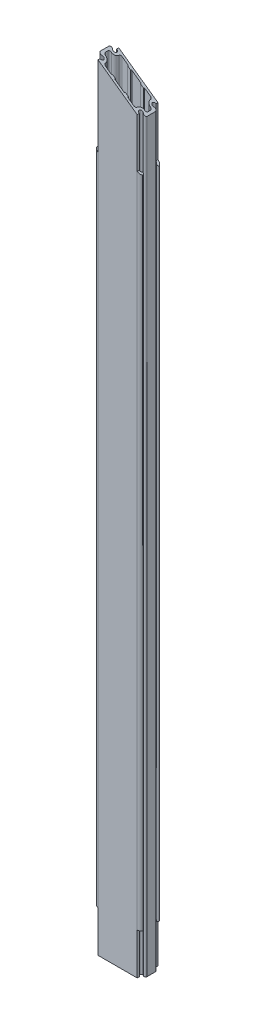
ISO-10303-21;
HEADER;
FILE_DESCRIPTION(('STEP AP214'),'2;1');
FILE_NAME('part.step','',(''),(''),'','','');
FILE_SCHEMA(('AUTOMOTIVE_DESIGN { 1 0 10303 214 1 1 1 1 }'));
ENDSEC;
DATA;
#1=APPLICATION_CONTEXT('core data for automotive mechanical design processes');
#2=APPLICATION_PROTOCOL_DEFINITION('international standard','automotive_design',2000,#1);
#3=PRODUCT_CONTEXT('',#1,'mechanical');
#4=PRODUCT('Part','Part','',(#3));
#5=PRODUCT_RELATED_PRODUCT_CATEGORY('part','',(#4));
#6=PRODUCT_DEFINITION_FORMATION('','',#4);
#7=PRODUCT_DEFINITION_CONTEXT('part definition',#1,'design');
#8=PRODUCT_DEFINITION('design','',#6,#7);
#9=PRODUCT_DEFINITION_SHAPE('','',#8);
#10=(LENGTH_UNIT() NAMED_UNIT(*) SI_UNIT(.MILLI.,.METRE.));
#11=(NAMED_UNIT(*) PLANE_ANGLE_UNIT() SI_UNIT($,.RADIAN.));
#12=(NAMED_UNIT(*) SI_UNIT($,.STERADIAN.) SOLID_ANGLE_UNIT());
#13=UNCERTAINTY_MEASURE_WITH_UNIT(LENGTH_MEASURE(1.E-05),#10,'distance_accuracy_value','');
#14=(GEOMETRIC_REPRESENTATION_CONTEXT(3) GLOBAL_UNCERTAINTY_ASSIGNED_CONTEXT((#13)) GLOBAL_UNIT_ASSIGNED_CONTEXT((#10,
#11,#12)) REPRESENTATION_CONTEXT('',''));
#15=CARTESIAN_POINT('',(0.,0.,0.));
#16=DIRECTION('',(0.,0.,1.));
#17=DIRECTION('',(1.,0.,0.));
#18=AXIS2_PLACEMENT_3D('',#15,#16,#17);
#19=CARTESIAN_POINT('',(-75.5,3000.,-25.5));
#20=DIRECTION('',(0.,-1.,0.));
#21=DIRECTION('',(0.,0.,-1.));
#22=AXIS2_PLACEMENT_3D('',#19,#20,#21);
#23=CYLINDRICAL_SURFACE('',#22,14.5);
#24=CARTESIAN_POINT('',(-75.5,2679.68014339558,-25.5));
#25=DIRECTION('',(0.579850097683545,0.814723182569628,0.));
#26=DIRECTION('',(0.814723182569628,-0.579850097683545,0.));
#27=AXIS2_PLACEMENT_3D('',#24,#25,#26);
#28=ELLIPSE('',#27,17.79745600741,14.5);
#29=CARTESIAN_POINT('',(-75.4999999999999,2679.68014339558,-40.));
#30=VERTEX_POINT('',#29);
#31=CARTESIAN_POINT('',(-88.1962844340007,2688.71626993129,-32.5038818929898));
#32=VERTEX_POINT('',#31);
#33=EDGE_CURVE('E457',#30,#32,#28,.T.);
#34=ORIENTED_EDGE('',*,*,#33,.F.);
#35=DIRECTION('',(0.,-1.,0.));
#36=VECTOR('',#35,1.);
#37=CARTESIAN_POINT('',(-75.5,3000.,-40.));
#38=LINE('',#37,#36);
#39=CARTESIAN_POINT('',(-75.5,160.,-40.));
#40=VERTEX_POINT('',#39);
#41=EDGE_CURVE('E474',#30,#40,#38,.T.);
#42=ORIENTED_EDGE('',*,*,#41,.T.);
#43=CARTESIAN_POINT('',(-75.5,160.,-25.5));
#44=DIRECTION('',(0.,-1.,0.));
#45=DIRECTION('',(0.,0.,-1.));
#46=AXIS2_PLACEMENT_3D('',#43,#44,#45);
#47=CIRCLE('',#46,14.5);
#48=CARTESIAN_POINT('',(-88.1962844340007,160.,-32.5038818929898));
#49=VERTEX_POINT('',#48);
#50=EDGE_CURVE('E579',#49,#40,#47,.T.);
#51=ORIENTED_EDGE('',*,*,#50,.F.);
#52=DIRECTION('',(0.,-1.,0.));
#53=VECTOR('',#52,1.);
#54=CARTESIAN_POINT('',(-88.1962844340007,3000.,-32.5038818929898));
#55=LINE('',#54,#53);
#56=EDGE_CURVE('E480',#32,#49,#55,.T.);
#57=ORIENTED_EDGE('',*,*,#56,.F.);
#58=EDGE_LOOP('',(#34,#42,#51,#57));
#59=FACE_BOUND('',#58,.T.);
#60=ADVANCED_FACE('F53',(#59),#23,.T.);
#61=CARTESIAN_POINT('',(-84.6938611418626,3000.,-30.5717765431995));
#62=DIRECTION('',(0.,-1.,0.));
#63=DIRECTION('',(0.,0.,-1.));
#64=AXIS2_PLACEMENT_3D('',#61,#62,#63);
#65=CYLINDRICAL_SURFACE('',#64,3.99999999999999);
#66=CARTESIAN_POINT('',(-84.6938611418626,2686.22354536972,-30.5717765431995));
#67=DIRECTION('',(0.579850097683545,0.814723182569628,0.));
#68=DIRECTION('',(0.814723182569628,-0.579850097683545,0.));
#69=AXIS2_PLACEMENT_3D('',#66,#67,#68);
#70=ELLIPSE('',#69,4.90964303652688,3.99999999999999);
#71=CARTESIAN_POINT('',(-81.1914378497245,2683.73082080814,-28.6396711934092));
#72=VERTEX_POINT('',#71);
#73=EDGE_CURVE('E482',#32,#72,#70,.T.);
#74=ORIENTED_EDGE('',*,*,#73,.F.);
#75=ORIENTED_EDGE('',*,*,#56,.T.);
#76=CARTESIAN_POINT('',(-84.6938611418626,160.,-30.5717765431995));
#77=DIRECTION('',(0.,-1.,0.));
#78=DIRECTION('',(0.,0.,-1.));
#79=AXIS2_PLACEMENT_3D('',#76,#77,#78);
#80=CIRCLE('',#79,3.99999999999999);
#81=CARTESIAN_POINT('',(-81.1914378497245,160.,-28.6396711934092));
#82=VERTEX_POINT('',#81);
#83=EDGE_CURVE('E575',#82,#49,#80,.T.);
#84=ORIENTED_EDGE('',*,*,#83,.F.);
#85=DIRECTION('',(0.,-1.,0.));
#86=VECTOR('',#85,1.);
#87=CARTESIAN_POINT('',(-81.1914378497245,3000.,-28.6396711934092));
#88=LINE('',#87,#86);
#89=EDGE_CURVE('E488',#72,#82,#88,.T.);
#90=ORIENTED_EDGE('',*,*,#89,.F.);
#91=EDGE_LOOP('',(#74,#75,#84,#90));
#92=FACE_BOUND('',#91,.T.);
#93=ADVANCED_FACE('F578',(#92),#65,.T.);
#94=CARTESIAN_POINT('',(-84.6938611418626,3000.,30.5717765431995));
#95=DIRECTION('',(0.,-1.,0.));
#96=DIRECTION('',(0.,0.,-1.));
#97=AXIS2_PLACEMENT_3D('',#94,#95,#96);
#98=CYLINDRICAL_SURFACE('',#97,3.99999999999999);
#99=CARTESIAN_POINT('',(-84.6938611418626,2686.22354536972,30.5717765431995));
#100=DIRECTION('',(0.579850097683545,0.814723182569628,0.));
#101=DIRECTION('',(0.814723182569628,-0.579850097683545,0.));
#102=AXIS2_PLACEMENT_3D('',#99,#100,#101);
#103=ELLIPSE('',#102,4.90964303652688,3.99999999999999);
#104=CARTESIAN_POINT('',(-81.1914378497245,2683.73082080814,28.6396711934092));
#105=VERTEX_POINT('',#104);
#106=CARTESIAN_POINT('',(-88.1962844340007,2688.71626993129,32.5038818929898));
#107=VERTEX_POINT('',#106);
#108=EDGE_CURVE('E531',#105,#107,#103,.T.);
#109=ORIENTED_EDGE('',*,*,#108,.F.);
#110=DIRECTION('',(0.,-1.,0.));
#111=VECTOR('',#110,1.);
#112=CARTESIAN_POINT('',(-81.1914378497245,3000.,28.6396711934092));
#113=LINE('',#112,#111);
#114=CARTESIAN_POINT('',(-81.1914378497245,160.,28.6396711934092));
#115=VERTEX_POINT('',#114);
#116=EDGE_CURVE('E540',#105,#115,#113,.T.);
#117=ORIENTED_EDGE('',*,*,#116,.T.);
#118=CARTESIAN_POINT('',(-84.6938611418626,160.,30.5717765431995));
#119=DIRECTION('',(0.,-1.,0.));
#120=DIRECTION('',(0.,0.,-1.));
#121=AXIS2_PLACEMENT_3D('',#118,#119,#120);
#122=CIRCLE('',#121,3.99999999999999);
#123=CARTESIAN_POINT('',(-88.1962844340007,160.,32.5038818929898));
#124=VERTEX_POINT('',#123);
#125=EDGE_CURVE('E583',#124,#115,#122,.T.);
#126=ORIENTED_EDGE('',*,*,#125,.F.);
#127=DIRECTION('',(0.,-1.,0.));
#128=VECTOR('',#127,1.);
#129=CARTESIAN_POINT('',(-88.1962844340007,3000.,32.5038818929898));
#130=LINE('',#129,#128);
#131=EDGE_CURVE('E542',#107,#124,#130,.T.);
#132=ORIENTED_EDGE('',*,*,#131,.F.);
#133=EDGE_LOOP('',(#109,#117,#126,#132));
#134=FACE_BOUND('',#133,.T.);
#135=ADVANCED_FACE('F538',(#134),#98,.T.);
#136=CARTESIAN_POINT('',(-75.5,3000.,25.5));
#137=DIRECTION('',(0.,-1.,0.));
#138=DIRECTION('',(0.,0.,-1.));
#139=AXIS2_PLACEMENT_3D('',#136,#137,#138);
#140=CYLINDRICAL_SURFACE('',#139,14.5);
#141=CARTESIAN_POINT('',(-75.5,2679.68014339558,25.5));
#142=DIRECTION('',(0.579850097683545,0.814723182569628,0.));
#143=DIRECTION('',(0.814723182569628,-0.579850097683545,0.));
#144=AXIS2_PLACEMENT_3D('',#141,#142,#143);
#145=ELLIPSE('',#144,17.79745600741,14.5);
#146=CARTESIAN_POINT('',(-75.5,2679.68014339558,40.));
#147=VERTEX_POINT('',#146);
#148=EDGE_CURVE('E543',#107,#147,#145,.T.);
#149=ORIENTED_EDGE('',*,*,#148,.F.);
#150=ORIENTED_EDGE('',*,*,#131,.T.);
#151=CARTESIAN_POINT('',(-75.5,160.,25.5));
#152=DIRECTION('',(0.,-1.,0.));
#153=DIRECTION('',(0.,0.,-1.));
#154=AXIS2_PLACEMENT_3D('',#151,#152,#153);
#155=CIRCLE('',#154,14.5);
#156=CARTESIAN_POINT('',(-75.5,160.,40.));
#157=VERTEX_POINT('',#156);
#158=EDGE_CURVE('E510',#157,#124,#155,.T.);
#159=ORIENTED_EDGE('',*,*,#158,.F.);
#160=DIRECTION('',(0.,-1.,0.));
#161=VECTOR('',#160,1.);
#162=CARTESIAN_POINT('',(-75.5,3000.,40.));
#163=LINE('',#162,#161);
#164=EDGE_CURVE('E888',#147,#157,#163,.T.);
#165=ORIENTED_EDGE('',*,*,#164,.F.);
#166=EDGE_LOOP('',(#149,#150,#159,#165));
#167=FACE_BOUND('',#166,.T.);
#168=ADVANCED_FACE('F913',(#167),#140,.T.);
#169=CARTESIAN_POINT('',(75.5,3000.,25.5));
#170=DIRECTION('',(0.,-1.,0.));
#171=DIRECTION('',(0.,0.,-1.));
#172=AXIS2_PLACEMENT_3D('',#169,#170,#171);
#173=CYLINDRICAL_SURFACE('',#172,14.5);
#174=CARTESIAN_POINT('',(75.5,2692.21129185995,25.5));
#175=DIRECTION('',(0.579850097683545,0.814723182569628,0.));
#176=DIRECTION('',(0.814723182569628,-0.579850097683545,0.));
#177=AXIS2_PLACEMENT_3D('',#174,#175,#176);
#178=ELLIPSE('',#177,17.79745600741,14.5);
#179=CARTESIAN_POINT('',(75.5,2692.21129185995,40.));
#180=VERTEX_POINT('',#179);
#181=CARTESIAN_POINT('',(88.1962844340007,2683.17516532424,32.5038818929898));
#182=VERTEX_POINT('',#181);
#183=EDGE_CURVE('E935',#180,#182,#178,.T.);
#184=ORIENTED_EDGE('',*,*,#183,.F.);
#185=DIRECTION('',(0.,-1.,0.));
#186=VECTOR('',#185,1.);
#187=CARTESIAN_POINT('',(75.5,3000.,40.));
#188=LINE('',#187,#186);
#189=CARTESIAN_POINT('',(75.5,160.,40.));
#190=VERTEX_POINT('',#189);
#191=EDGE_CURVE('E885',#180,#190,#188,.T.);
#192=ORIENTED_EDGE('',*,*,#191,.T.);
#193=CARTESIAN_POINT('',(75.5,160.,25.5));
#194=DIRECTION('',(0.,-1.,0.));
#195=DIRECTION('',(0.,0.,-1.));
#196=AXIS2_PLACEMENT_3D('',#193,#194,#195);
#197=CIRCLE('',#196,14.5);
#198=CARTESIAN_POINT('',(88.1962844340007,160.,32.5038818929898));
#199=VERTEX_POINT('',#198);
#200=EDGE_CURVE('E967',#199,#190,#197,.T.);
#201=ORIENTED_EDGE('',*,*,#200,.F.);
#202=DIRECTION('',(0.,-1.,0.));
#203=VECTOR('',#202,1.);
#204=CARTESIAN_POINT('',(88.1962844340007,3000.,32.5038818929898));
#205=LINE('',#204,#203);
#206=EDGE_CURVE('E883',#182,#199,#205,.T.);
#207=ORIENTED_EDGE('',*,*,#206,.F.);
#208=EDGE_LOOP('',(#184,#192,#201,#207));
#209=FACE_BOUND('',#208,.T.);
#210=ADVANCED_FACE('F989',(#209),#173,.T.);
#211=CARTESIAN_POINT('',(84.6938611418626,3000.,30.5717765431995));
#212=DIRECTION('',(0.,-1.,0.));
#213=DIRECTION('',(0.,0.,-1.));
#214=AXIS2_PLACEMENT_3D('',#211,#212,#213);
#215=CYLINDRICAL_SURFACE('',#214,3.99999999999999);
#216=CARTESIAN_POINT('',(84.6938611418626,2685.66788988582,30.5717765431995));
#217=DIRECTION('',(0.579850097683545,0.814723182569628,0.));
#218=DIRECTION('',(0.814723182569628,-0.579850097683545,0.));
#219=AXIS2_PLACEMENT_3D('',#216,#217,#218);
#220=ELLIPSE('',#219,4.90964303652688,3.99999999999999);
#221=CARTESIAN_POINT('',(81.1914378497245,2688.16061444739,28.6396711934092));
#222=VERTEX_POINT('',#221);
#223=EDGE_CURVE('E933',#182,#222,#220,.T.);
#224=ORIENTED_EDGE('',*,*,#223,.F.);
#225=ORIENTED_EDGE('',*,*,#206,.T.);
#226=CARTESIAN_POINT('',(84.6938611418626,160.,30.5717765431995));
#227=DIRECTION('',(0.,-1.,0.));
#228=DIRECTION('',(0.,0.,-1.));
#229=AXIS2_PLACEMENT_3D('',#226,#227,#228);
#230=CIRCLE('',#229,3.99999999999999);
#231=CARTESIAN_POINT('',(81.1914378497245,160.,28.6396711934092));
#232=VERTEX_POINT('',#231);
#233=EDGE_CURVE('E964',#232,#199,#230,.T.);
#234=ORIENTED_EDGE('',*,*,#233,.F.);
#235=DIRECTION('',(0.,-1.,0.));
#236=VECTOR('',#235,1.);
#237=CARTESIAN_POINT('',(81.1914378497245,3000.,28.6396711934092));
#238=LINE('',#237,#236);
#239=EDGE_CURVE('E881',#222,#232,#238,.T.);
#240=ORIENTED_EDGE('',*,*,#239,.F.);
#241=EDGE_LOOP('',(#224,#225,#234,#240));
#242=FACE_BOUND('',#241,.T.);
#243=ADVANCED_FACE('F996',(#242),#215,.T.);
#244=CARTESIAN_POINT('',(75.5,3000.,-25.5));
#245=DIRECTION('',(0.,-1.,0.));
#246=DIRECTION('',(0.,0.,-1.));
#247=AXIS2_PLACEMENT_3D('',#244,#245,#246);
#248=CYLINDRICAL_SURFACE('',#247,6.5);
#249=DIRECTION('',(0.,-1.,0.));
#250=VECTOR('',#249,1.);
#251=CARTESIAN_POINT('',(75.5,3000.,-32.));
#252=LINE('',#251,#250);
#253=CARTESIAN_POINT('',(75.5,2882.21129185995,-32.));
#254=VERTEX_POINT('',#253);
#255=CARTESIAN_POINT('',(75.5,2692.21129185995,-32.));
#256=VERTEX_POINT('',#255);
#257=EDGE_CURVE('E922',#254,#256,#252,.T.);
#258=ORIENTED_EDGE('',*,*,#257,.F.);
#259=CARTESIAN_POINT('',(75.5,2882.21129185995,-25.5));
#260=DIRECTION('',(-0.579850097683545,-0.814723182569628,0.));
#261=DIRECTION('',(0.814723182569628,-0.579850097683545,0.));
#262=AXIS2_PLACEMENT_3D('',#259,#260,#261);
#263=ELLIPSE('',#262,7.9781699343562,6.5);
#264=CARTESIAN_POINT('',(79.7220192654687,2879.20642059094,-20.5578796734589));
#265=VERTEX_POINT('',#264);
#266=EDGE_CURVE('E656',#254,#265,#263,.F.);
#267=ORIENTED_EDGE('',*,*,#266,.T.);
#268=DIRECTION('',(0.,-1.,0.));
#269=VECTOR('',#268,1.);
#270=CARTESIAN_POINT('',(79.7220192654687,3000.,-20.5578796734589));
#271=LINE('',#270,#269);
#272=CARTESIAN_POINT('',(79.7220192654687,0.,-20.5578796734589));
#273=VERTEX_POINT('',#272);
#274=EDGE_CURVE('E872',#265,#273,#271,.T.);
#275=ORIENTED_EDGE('',*,*,#274,.T.);
#276=CARTESIAN_POINT('',(75.5,0.,-25.5));
#277=DIRECTION('',(0.,-1.,0.));
#278=DIRECTION('',(0.,0.,1.));
#279=AXIS2_PLACEMENT_3D('',#276,#277,#278);
#280=CIRCLE('',#279,6.5);
#281=CARTESIAN_POINT('',(75.5,0.,-32.));
#282=VERTEX_POINT('',#281);
#283=EDGE_CURVE('E841',#273,#282,#280,.T.);
#284=ORIENTED_EDGE('',*,*,#283,.T.);
#285=DIRECTION('',(0.,-1.,0.));
#286=VECTOR('',#285,1.);
#287=CARTESIAN_POINT('',(75.5,3000.,-32.));
#288=LINE('',#287,#286);
#289=CARTESIAN_POINT('',(75.5,160.,-32.));
#290=VERTEX_POINT('',#289);
#291=EDGE_CURVE('E501',#282,#290,#288,.F.);
#292=ORIENTED_EDGE('',*,*,#291,.T.);
#293=CARTESIAN_POINT('',(75.5,160.,-25.5));
#294=DIRECTION('',(0.,-1.,0.));
#295=DIRECTION('',(0.,0.,-1.));
#296=AXIS2_PLACEMENT_3D('',#293,#294,#295);
#297=CIRCLE('',#296,6.5);
#298=CARTESIAN_POINT('',(81.1914378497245,160.,-28.6396711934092));
#299=VERTEX_POINT('',#298);
#300=EDGE_CURVE('E499',#299,#290,#297,.F.);
#301=ORIENTED_EDGE('',*,*,#300,.F.);
#302=DIRECTION('',(0.,-1.,0.));
#303=VECTOR('',#302,1.);
#304=CARTESIAN_POINT('',(81.1914378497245,3000.,-28.6396711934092));
#305=LINE('',#304,#303);
#306=CARTESIAN_POINT('',(81.1914378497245,2688.16061444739,-28.6396711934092));
#307=VERTEX_POINT('',#306);
#308=EDGE_CURVE('E840',#307,#299,#305,.T.);
#309=ORIENTED_EDGE('',*,*,#308,.F.);
#310=CARTESIAN_POINT('',(75.5,2692.21129185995,-25.5));
#311=DIRECTION('',(-0.579850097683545,-0.814723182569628,0.));
#312=DIRECTION('',(0.814723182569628,-0.579850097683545,0.));
#313=AXIS2_PLACEMENT_3D('',#310,#311,#312);
#314=ELLIPSE('',#313,7.9781699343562,6.5);
#315=EDGE_CURVE('E523',#307,#256,#314,.F.);
#316=ORIENTED_EDGE('',*,*,#315,.T.);
#317=EDGE_LOOP('',(#258,#267,#275,#284,#292,#301,#309,#316));
#318=FACE_BOUND('',#317,.T.);
#319=ADVANCED_FACE('F1049',(#318),#248,.F.);
#320=CARTESIAN_POINT('',(90.,2871.89143525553,-40.));
#321=DIRECTION('',(-0.579850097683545,-0.814723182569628,0.));
#322=DIRECTION('',(0.814723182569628,-0.579850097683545,0.));
#323=AXIS2_PLACEMENT_3D('',#320,#321,#322);
#324=PLANE('',#323);
#325=CARTESIAN_POINT('',(75.5,2882.21129185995,-25.5));
#326=DIRECTION('',(-0.579850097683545,-0.814723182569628,0.));
#327=DIRECTION('',(0.814723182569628,-0.579850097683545,0.));
#328=AXIS2_PLACEMENT_3D('',#325,#326,#327);
#329=ELLIPSE('',#328,17.79745600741,14.5);
#330=CARTESIAN_POINT('',(61.,2892.53114846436,-25.5));
#331=VERTEX_POINT('',#330);
#332=CARTESIAN_POINT('',(75.5,2882.21129185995,-11.));
#333=VERTEX_POINT('',#332);
#334=EDGE_CURVE('E654',#331,#333,#329,.F.);
#335=ORIENTED_EDGE('',*,*,#334,.T.);
#336=CARTESIAN_POINT('',(75.5,2882.21129185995,-4.5));
#337=DIRECTION('',(-0.579850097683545,-0.814723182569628,0.));
#338=DIRECTION('',(0.814723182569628,-0.579850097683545,0.));
#339=AXIS2_PLACEMENT_3D('',#336,#337,#338);
#340=ELLIPSE('',#339,7.9781699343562,6.5);
#341=CARTESIAN_POINT('',(82.,2877.58514924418,-4.5));
#342=VERTEX_POINT('',#341);
#343=EDGE_CURVE('E497',#333,#342,#340,.T.);
#344=ORIENTED_EDGE('',*,*,#343,.T.);
#345=DIRECTION('',(0.,0.,1.));
#346=VECTOR('',#345,1.);
#347=CARTESIAN_POINT('',(82.,2877.58514924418,-4.5));
#348=LINE('',#347,#346);
#349=CARTESIAN_POINT('',(82.,2877.58514924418,4.5));
#350=VERTEX_POINT('',#349);
#351=EDGE_CURVE('E594',#342,#350,#348,.T.);
#352=ORIENTED_EDGE('',*,*,#351,.T.);
#353=CARTESIAN_POINT('',(75.5,2882.21129185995,4.5));
#354=DIRECTION('',(-0.579850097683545,-0.814723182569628,0.));
#355=DIRECTION('',(0.814723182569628,-0.579850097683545,0.));
#356=AXIS2_PLACEMENT_3D('',#353,#354,#355);
#357=ELLIPSE('',#356,7.9781699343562,6.5);
#358=CARTESIAN_POINT('',(75.5,2882.21129185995,11.));
#359=VERTEX_POINT('',#358);
#360=EDGE_CURVE('E596',#350,#359,#357,.T.);
#361=ORIENTED_EDGE('',*,*,#360,.T.);
#362=CARTESIAN_POINT('',(75.5,2882.21129185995,25.5));
#363=DIRECTION('',(-0.579850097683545,-0.814723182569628,0.));
#364=DIRECTION('',(0.814723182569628,-0.579850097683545,0.));
#365=AXIS2_PLACEMENT_3D('',#362,#363,#364);
#366=ELLIPSE('',#365,17.79745600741,14.5);
#367=CARTESIAN_POINT('',(61.,2892.53114846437,25.5));
#368=VERTEX_POINT('',#367);
#369=EDGE_CURVE('E598',#359,#368,#366,.F.);
#370=ORIENTED_EDGE('',*,*,#369,.T.);
#371=CARTESIAN_POINT('',(54.5,2897.15729108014,25.5));
#372=DIRECTION('',(-0.579850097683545,-0.814723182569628,0.));
#373=DIRECTION('',(0.814723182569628,-0.579850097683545,0.));
#374=AXIS2_PLACEMENT_3D('',#371,#372,#373);
#375=ELLIPSE('',#374,7.9781699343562,6.5);
#376=CARTESIAN_POINT('',(54.5,2897.15729108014,32.));
#377=VERTEX_POINT('',#376);
#378=EDGE_CURVE('E600',#368,#377,#375,.T.);
#379=ORIENTED_EDGE('',*,*,#378,.T.);
#380=DIRECTION('',(-0.814723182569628,0.579850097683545,0.));
#381=VECTOR('',#380,1.);
#382=CARTESIAN_POINT('',(-8.67621908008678,2942.12070637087,31.9999999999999));
#383=LINE('',#382,#381);
#384=CARTESIAN_POINT('',(32.5172988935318,2912.80269267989,32.));
#385=VERTEX_POINT('',#384);
#386=EDGE_CURVE('E602',#377,#385,#383,.T.);
#387=ORIENTED_EDGE('',*,*,#386,.T.);
#388=DIRECTION('',(-0.584524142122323,0.416014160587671,-0.696608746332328));
#389=VECTOR('',#388,1.);
#390=CARTESIAN_POINT('',(9.23186618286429,2929.37526692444,4.24950191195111));
#391=LINE('',#390,#389);
#392=CARTESIAN_POINT('',(30.,2914.59429017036,29.));
#393=VERTEX_POINT('',#392);
#394=EDGE_CURVE('E604',#385,#393,#391,.T.);
#395=ORIENTED_EDGE('',*,*,#394,.T.);
#396=DIRECTION('',(-0.814723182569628,0.579850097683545,0.));
#397=VECTOR('',#396,1.);
#398=CARTESIAN_POINT('',(-16.9848749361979,2948.03409513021,29.));
#399=LINE('',#398,#397);
#400=CARTESIAN_POINT('',(20.,2921.71143265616,29.));
#401=VERTEX_POINT('',#400);
#402=EDGE_CURVE('E606',#393,#401,#399,.T.);
#403=ORIENTED_EDGE('',*,*,#402,.T.);
#404=DIRECTION('',(-0.584524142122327,0.416014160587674,0.696608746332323));
#405=VECTOR('',#404,1.);
#406=CARTESIAN_POINT('',(0.962544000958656,2935.2606613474,51.6879565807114));
#407=LINE('',#406,#405);
#408=CARTESIAN_POINT('',(17.4827011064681,2923.50303014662,32.));
#409=VERTEX_POINT('',#408);
#410=EDGE_CURVE('E608',#401,#409,#407,.T.);
#411=ORIENTED_EDGE('',*,*,#410,.T.);
#412=DIRECTION('',(-0.814723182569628,0.579850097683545,0.));
#413=VECTOR('',#412,1.);
#414=CARTESIAN_POINT('',(-41.8649122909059,2965.74157222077,32.));
#415=LINE('',#414,#413);
#416=CARTESIAN_POINT('',(-17.4827011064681,2948.38840510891,32.));
#417=VERTEX_POINT('',#416);
#418=EDGE_CURVE('E610',#409,#417,#415,.T.);
#419=ORIENTED_EDGE('',*,*,#418,.T.);
#420=DIRECTION('',(-0.584524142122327,0.416014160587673,-0.696608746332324));
#421=VECTOR('',#420,1.);
#422=CARTESIAN_POINT('',(-32.1147447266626,2958.80223903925,14.5622094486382));
#423=LINE('',#422,#421);
#424=CARTESIAN_POINT('',(-20.,2950.18000259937,29.));
#425=VERTEX_POINT('',#424);
#426=EDGE_CURVE('E612',#417,#425,#423,.T.);
#427=ORIENTED_EDGE('',*,*,#426,.T.);
#428=DIRECTION('',(-0.814723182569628,0.579850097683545,0.));
#429=VECTOR('',#428,1.);
#430=CARTESIAN_POINT('',(-43.5358295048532,2966.93078781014,29.));
#431=LINE('',#430,#429);
#432=CARTESIAN_POINT('',(-30.,2957.29714508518,29.));
#433=VERTEX_POINT('',#432);
#434=EDGE_CURVE('E614',#425,#433,#431,.T.);
#435=ORIENTED_EDGE('',*,*,#434,.T.);
#436=DIRECTION('',(-0.584524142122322,0.41601416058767,0.696608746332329));
#437=VECTOR('',#436,1.);
#438=CARTESIAN_POINT('',(-40.3840669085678,2964.68763346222,41.3752490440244));
#439=LINE('',#438,#437);
#440=CARTESIAN_POINT('',(-32.5172988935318,2959.08874257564,32.));
#441=VERTEX_POINT('',#440);
#442=EDGE_CURVE('E616',#433,#441,#439,.T.);
#443=ORIENTED_EDGE('',*,*,#442,.T.);
#444=DIRECTION('',(-0.814723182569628,0.579850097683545,0.));
#445=VECTOR('',#444,1.);
#446=CARTESIAN_POINT('',(-51.8444853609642,2972.84417656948,32.));
#447=LINE('',#446,#445);
#448=CARTESIAN_POINT('',(-54.5,2974.7341441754,32.));
#449=VERTEX_POINT('',#448);
#450=EDGE_CURVE('E618',#441,#449,#447,.T.);
#451=ORIENTED_EDGE('',*,*,#450,.T.);
#452=CARTESIAN_POINT('',(-54.5,2974.7341441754,25.5));
#453=DIRECTION('',(-0.579850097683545,-0.814723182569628,0.));
#454=DIRECTION('',(0.814723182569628,-0.579850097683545,0.));
#455=AXIS2_PLACEMENT_3D('',#452,#453,#454);
#456=ELLIPSE('',#455,7.9781699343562,6.5);
#457=CARTESIAN_POINT('',(-61.,2979.36028679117,25.5));
#458=VERTEX_POINT('',#457);
#459=EDGE_CURVE('E620',#449,#458,#456,.T.);
#460=ORIENTED_EDGE('',*,*,#459,.T.);
#461=CARTESIAN_POINT('',(-75.5,2989.68014339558,25.5));
#462=DIRECTION('',(-0.579850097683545,-0.814723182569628,0.));
#463=DIRECTION('',(0.814723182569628,-0.579850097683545,0.));
#464=AXIS2_PLACEMENT_3D('',#461,#462,#463);
#465=ELLIPSE('',#464,17.79745600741,14.5);
#466=CARTESIAN_POINT('',(-75.5,2989.68014339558,11.));
#467=VERTEX_POINT('',#466);
#468=EDGE_CURVE('E622',#458,#467,#465,.F.);
#469=ORIENTED_EDGE('',*,*,#468,.T.);
#470=CARTESIAN_POINT('',(-75.5,2989.68014339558,4.5));
#471=DIRECTION('',(-0.579850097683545,-0.814723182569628,0.));
#472=DIRECTION('',(0.814723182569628,-0.579850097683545,0.));
#473=AXIS2_PLACEMENT_3D('',#470,#471,#472);
#474=ELLIPSE('',#473,7.9781699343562,6.5);
#475=CARTESIAN_POINT('',(-82.,2994.30628601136,4.5));
#476=VERTEX_POINT('',#475);
#477=EDGE_CURVE('E624',#467,#476,#474,.T.);
#478=ORIENTED_EDGE('',*,*,#477,.T.);
#479=DIRECTION('',(0.,0.,-1.));
#480=VECTOR('',#479,1.);
#481=CARTESIAN_POINT('',(-82.,2994.30628601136,-4.5));
#482=LINE('',#481,#480);
#483=CARTESIAN_POINT('',(-82.,2994.30628601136,-4.5));
#484=VERTEX_POINT('',#483);
#485=EDGE_CURVE('E626',#476,#484,#482,.T.);
#486=ORIENTED_EDGE('',*,*,#485,.T.);
#487=CARTESIAN_POINT('',(-75.5,2989.68014339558,-4.5));
#488=DIRECTION('',(-0.579850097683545,-0.814723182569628,0.));
#489=DIRECTION('',(0.814723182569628,-0.579850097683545,0.));
#490=AXIS2_PLACEMENT_3D('',#487,#488,#489);
#491=ELLIPSE('',#490,7.9781699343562,6.5);
#492=CARTESIAN_POINT('',(-75.5,2989.68014339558,-11.));
#493=VERTEX_POINT('',#492);
#494=EDGE_CURVE('E628',#484,#493,#491,.T.);
#495=ORIENTED_EDGE('',*,*,#494,.T.);
#496=CARTESIAN_POINT('',(-75.5,2989.68014339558,-25.5));
#497=DIRECTION('',(-0.579850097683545,-0.814723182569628,0.));
#498=DIRECTION('',(0.814723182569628,-0.579850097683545,0.));
#499=AXIS2_PLACEMENT_3D('',#496,#497,#498);
#500=ELLIPSE('',#499,17.79745600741,14.5);
#501=CARTESIAN_POINT('',(-61.,2979.36028679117,-25.5));
#502=VERTEX_POINT('',#501);
#503=EDGE_CURVE('E630',#493,#502,#500,.F.);
#504=ORIENTED_EDGE('',*,*,#503,.T.);
#505=CARTESIAN_POINT('',(-54.5,2974.7341441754,-25.5));
#506=DIRECTION('',(-0.579850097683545,-0.814723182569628,0.));
#507=DIRECTION('',(0.814723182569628,-0.579850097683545,0.));
#508=AXIS2_PLACEMENT_3D('',#505,#506,#507);
#509=ELLIPSE('',#508,7.9781699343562,6.5);
#510=CARTESIAN_POINT('',(-54.5,2974.7341441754,-32.));
#511=VERTEX_POINT('',#510);
#512=EDGE_CURVE('E632',#502,#511,#509,.T.);
#513=ORIENTED_EDGE('',*,*,#512,.T.);
#514=DIRECTION('',(0.814723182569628,-0.579850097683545,0.));
#515=VECTOR('',#514,1.);
#516=CARTESIAN_POINT('',(-51.8444853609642,2972.84417656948,-32.));
#517=LINE('',#516,#515);
#518=CARTESIAN_POINT('',(-32.5172988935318,2959.08874257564,-32.));
#519=VERTEX_POINT('',#518);
#520=EDGE_CURVE('E634',#511,#519,#517,.T.);
#521=ORIENTED_EDGE('',*,*,#520,.T.);
#522=DIRECTION('',(0.584524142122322,-0.41601416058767,0.696608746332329));
#523=VECTOR('',#522,1.);
#524=CARTESIAN_POINT('',(-40.3840669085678,2964.68763346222,-41.3752490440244));
#525=LINE('',#524,#523);
#526=CARTESIAN_POINT('',(-30.,2957.29714508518,-29.));
#527=VERTEX_POINT('',#526);
#528=EDGE_CURVE('E636',#519,#527,#525,.T.);
#529=ORIENTED_EDGE('',*,*,#528,.T.);
#530=DIRECTION('',(0.814723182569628,-0.579850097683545,0.));
#531=VECTOR('',#530,1.);
#532=CARTESIAN_POINT('',(-43.5358295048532,2966.93078781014,-29.));
#533=LINE('',#532,#531);
#534=CARTESIAN_POINT('',(-20.,2950.18000259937,-29.));
#535=VERTEX_POINT('',#534);
#536=EDGE_CURVE('E638',#527,#535,#533,.T.);
#537=ORIENTED_EDGE('',*,*,#536,.T.);
#538=DIRECTION('',(0.584524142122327,-0.416014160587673,-0.696608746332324));
#539=VECTOR('',#538,1.);
#540=CARTESIAN_POINT('',(-32.1147447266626,2958.80223903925,-14.5622094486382));
#541=LINE('',#540,#539);
#542=CARTESIAN_POINT('',(-17.4827011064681,2948.38840510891,-32.));
#543=VERTEX_POINT('',#542);
#544=EDGE_CURVE('E640',#535,#543,#541,.T.);
#545=ORIENTED_EDGE('',*,*,#544,.T.);
#546=DIRECTION('',(0.814723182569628,-0.579850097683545,0.));
#547=VECTOR('',#546,1.);
#548=CARTESIAN_POINT('',(-41.8649122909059,2965.74157222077,-32.));
#549=LINE('',#548,#547);
#550=CARTESIAN_POINT('',(17.4827011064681,2923.50303014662,-32.));
#551=VERTEX_POINT('',#550);
#552=EDGE_CURVE('E642',#543,#551,#549,.T.);
#553=ORIENTED_EDGE('',*,*,#552,.T.);
#554=DIRECTION('',(0.584524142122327,-0.416014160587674,0.696608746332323));
#555=VECTOR('',#554,1.);
#556=CARTESIAN_POINT('',(0.962544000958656,2935.2606613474,-51.6879565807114));
#557=LINE('',#556,#555);
#558=CARTESIAN_POINT('',(20.,2921.71143265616,-29.));
#559=VERTEX_POINT('',#558);
#560=EDGE_CURVE('E644',#551,#559,#557,.T.);
#561=ORIENTED_EDGE('',*,*,#560,.T.);
#562=DIRECTION('',(0.814723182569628,-0.579850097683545,0.));
#563=VECTOR('',#562,1.);
#564=CARTESIAN_POINT('',(-16.9848749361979,2948.03409513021,-29.));
#565=LINE('',#564,#563);
#566=CARTESIAN_POINT('',(30.,2914.59429017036,-29.));
#567=VERTEX_POINT('',#566);
#568=EDGE_CURVE('E646',#559,#567,#565,.T.);
#569=ORIENTED_EDGE('',*,*,#568,.T.);
#570=DIRECTION('',(0.584524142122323,-0.416014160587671,-0.696608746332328));
#571=VECTOR('',#570,1.);
#572=CARTESIAN_POINT('',(9.23186618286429,2929.37526692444,-4.24950191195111));
#573=LINE('',#572,#571);
#574=CARTESIAN_POINT('',(32.5172988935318,2912.80269267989,-32.));
#575=VERTEX_POINT('',#574);
#576=EDGE_CURVE('E648',#567,#575,#573,.T.);
#577=ORIENTED_EDGE('',*,*,#576,.T.);
#578=DIRECTION('',(0.814723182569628,-0.579850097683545,0.));
#579=VECTOR('',#578,1.);
#580=CARTESIAN_POINT('',(-8.67621908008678,2942.12070637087,-31.9999999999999));
#581=LINE('',#580,#579);
#582=CARTESIAN_POINT('',(54.5,2897.15729108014,-32.));
#583=VERTEX_POINT('',#582);
#584=EDGE_CURVE('E650',#575,#583,#581,.T.);
#585=ORIENTED_EDGE('',*,*,#584,.T.);
#586=CARTESIAN_POINT('',(54.5,2897.15729108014,-25.5));
#587=DIRECTION('',(-0.579850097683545,-0.814723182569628,0.));
#588=DIRECTION('',(0.814723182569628,-0.579850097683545,0.));
#589=AXIS2_PLACEMENT_3D('',#586,#587,#588);
#590=ELLIPSE('',#589,7.9781699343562,6.5);
#591=EDGE_CURVE('E652',#583,#331,#590,.T.);
#592=ORIENTED_EDGE('',*,*,#591,.T.);
#593=EDGE_LOOP('',(#335,#344,#352,#361,#370,#379,#387,#395,#403,#411,#419,#427,#435,#443,#451,
#460,#469,#478,#486,#495,#504,#513,#521,#529,#537,#545,#553,#561,#569,#577,#585,#592));
#594=FACE_BOUND('',#593,.T.);
#595=DIRECTION('',(0.814723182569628,-0.579850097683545,0.));
#596=VECTOR('',#595,1.);
#597=CARTESIAN_POINT('',(90.,2871.89143525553,-40.));
#598=LINE('',#597,#596);
#599=CARTESIAN_POINT('',(-75.5,2989.68014339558,-40.));
#600=VERTEX_POINT('',#599);
#601=CARTESIAN_POINT('',(75.5,2882.21129185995,-40.));
#602=VERTEX_POINT('',#601);
#603=EDGE_CURVE('E587',#600,#602,#598,.T.);
#604=ORIENTED_EDGE('',*,*,#603,.F.);
#605=DIRECTION('',(0.,0.,-1.));
#606=VECTOR('',#605,1.);
#607=CARTESIAN_POINT('',(-75.5,2989.68014339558,-40.));
#608=LINE('',#607,#606);
#609=CARTESIAN_POINT('',(-75.5,2989.68014339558,-32.));
#610=VERTEX_POINT('',#609);
#611=EDGE_CURVE('E463',#610,#600,#608,.T.);
#612=ORIENTED_EDGE('',*,*,#611,.F.);
#613=CARTESIAN_POINT('',(-75.5,2989.68014339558,-25.5));
#614=DIRECTION('',(-0.579850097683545,-0.814723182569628,0.));
#615=DIRECTION('',(0.814723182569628,-0.579850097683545,0.));
#616=AXIS2_PLACEMENT_3D('',#613,#614,#615);
#617=ELLIPSE('',#616,7.9781699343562,6.5);
#618=CARTESIAN_POINT('',(-79.7220192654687,2992.6850146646,-20.5578796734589));
#619=VERTEX_POINT('',#618);
#620=EDGE_CURVE('E675',#619,#610,#617,.F.);
#621=ORIENTED_EDGE('',*,*,#620,.F.);
#622=CARTESIAN_POINT('',(-83.7691890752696,2995.56544308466,-15.8204308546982));
#623=DIRECTION('',(-0.579850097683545,-0.814723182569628,0.));
#624=DIRECTION('',(0.814723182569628,-0.579850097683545,0.));
#625=AXIS2_PLACEMENT_3D('',#622,#623,#624);
#626=ELLIPSE('',#625,7.64776436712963,6.23081092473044);
#627=CARTESIAN_POINT('',(-90.,3000.,-15.8204308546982));
#628=VERTEX_POINT('',#627);
#629=EDGE_CURVE('E672',#628,#619,#626,.T.);
#630=ORIENTED_EDGE('',*,*,#629,.F.);
#631=DIRECTION('',(0.,0.,1.));
#632=VECTOR('',#631,1.);
#633=CARTESIAN_POINT('',(-90.,3000.,15.8204308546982));
#634=LINE('',#633,#632);
#635=CARTESIAN_POINT('',(-90.,3000.,15.8204308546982));
#636=VERTEX_POINT('',#635);
#637=EDGE_CURVE('E838',#628,#636,#634,.T.);
#638=ORIENTED_EDGE('',*,*,#637,.T.);
#639=CARTESIAN_POINT('',(-83.7691890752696,2995.56544308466,15.8204308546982));
#640=DIRECTION('',(-0.579850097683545,-0.814723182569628,0.));
#641=DIRECTION('',(0.814723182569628,-0.579850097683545,0.));
#642=AXIS2_PLACEMENT_3D('',#639,#640,#641);
#643=ELLIPSE('',#642,7.64776436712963,6.23081092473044);
#644=CARTESIAN_POINT('',(-79.7220192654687,2992.6850146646,20.5578796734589));
#645=VERTEX_POINT('',#644);
#646=EDGE_CURVE('E669',#645,#636,#643,.T.);
#647=ORIENTED_EDGE('',*,*,#646,.F.);
#648=CARTESIAN_POINT('',(-75.5,2989.68014339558,25.5));
#649=DIRECTION('',(-0.579850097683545,-0.814723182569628,0.));
#650=DIRECTION('',(0.814723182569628,-0.579850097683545,0.));
#651=AXIS2_PLACEMENT_3D('',#648,#649,#650);
#652=ELLIPSE('',#651,7.9781699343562,6.5);
#653=CARTESIAN_POINT('',(-75.5,2989.68014339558,32.));
#654=VERTEX_POINT('',#653);
#655=EDGE_CURVE('E667',#654,#645,#652,.F.);
#656=ORIENTED_EDGE('',*,*,#655,.F.);
#657=DIRECTION('',(0.,0.,-1.));
#658=VECTOR('',#657,1.);
#659=CARTESIAN_POINT('',(-75.5,2989.68014339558,-40.));
#660=LINE('',#659,#658);
#661=CARTESIAN_POINT('',(-75.5,2989.68014339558,40.));
#662=VERTEX_POINT('',#661);
#663=EDGE_CURVE('E1004',#662,#654,#660,.T.);
#664=ORIENTED_EDGE('',*,*,#663,.F.);
#665=DIRECTION('',(0.814723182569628,-0.579850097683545,0.));
#666=VECTOR('',#665,1.);
#667=CARTESIAN_POINT('',(90.,2871.89143525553,40.));
#668=LINE('',#667,#666);
#669=CARTESIAN_POINT('',(75.5,2882.21129185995,40.));
#670=VERTEX_POINT('',#669);
#671=EDGE_CURVE('E581',#662,#670,#668,.T.);
#672=ORIENTED_EDGE('',*,*,#671,.T.);
#673=DIRECTION('',(0.,0.,-1.));
#674=VECTOR('',#673,1.);
#675=CARTESIAN_POINT('',(75.5,2882.21129185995,-40.));
#676=LINE('',#675,#674);
#677=CARTESIAN_POINT('',(75.5,2882.21129185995,32.));
#678=VERTEX_POINT('',#677);
#679=EDGE_CURVE('E521',#670,#678,#676,.T.);
#680=ORIENTED_EDGE('',*,*,#679,.T.);
#681=CARTESIAN_POINT('',(75.5,2882.21129185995,25.5));
#682=DIRECTION('',(-0.579850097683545,-0.814723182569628,0.));
#683=DIRECTION('',(0.814723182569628,-0.579850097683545,0.));
#684=AXIS2_PLACEMENT_3D('',#681,#682,#683);
#685=ELLIPSE('',#684,7.9781699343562,6.5);
#686=CARTESIAN_POINT('',(79.7220192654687,2879.20642059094,20.5578796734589));
#687=VERTEX_POINT('',#686);
#688=EDGE_CURVE('E664',#687,#678,#685,.F.);
#689=ORIENTED_EDGE('',*,*,#688,.F.);
#690=CARTESIAN_POINT('',(83.7691890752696,2876.32599217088,15.8204308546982));
#691=DIRECTION('',(-0.579850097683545,-0.814723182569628,0.));
#692=DIRECTION('',(0.814723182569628,-0.579850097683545,0.));
#693=AXIS2_PLACEMENT_3D('',#690,#691,#692);
#694=ELLIPSE('',#693,7.64776436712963,6.23081092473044);
#695=CARTESIAN_POINT('',(90.,2871.89143525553,15.8204308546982));
#696=VERTEX_POINT('',#695);
#697=EDGE_CURVE('E661',#696,#687,#694,.T.);
#698=ORIENTED_EDGE('',*,*,#697,.F.);
#699=DIRECTION('',(0.,0.,1.));
#700=VECTOR('',#699,1.);
#701=CARTESIAN_POINT('',(90.,2871.89143525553,-40.));
#702=LINE('',#701,#700);
#703=CARTESIAN_POINT('',(90.,2871.89143525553,-15.8204308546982));
#704=VERTEX_POINT('',#703);
#705=EDGE_CURVE('E589',#704,#696,#702,.T.);
#706=ORIENTED_EDGE('',*,*,#705,.F.);
#707=CARTESIAN_POINT('',(83.7691890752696,2876.32599217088,-15.8204308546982));
#708=DIRECTION('',(-0.579850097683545,-0.814723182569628,0.));
#709=DIRECTION('',(0.814723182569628,-0.579850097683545,0.));
#710=AXIS2_PLACEMENT_3D('',#707,#708,#709);
#711=ELLIPSE('',#710,7.64776436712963,6.23081092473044);
#712=EDGE_CURVE('E658',#265,#704,#711,.T.);
#713=ORIENTED_EDGE('',*,*,#712,.F.);
#714=ORIENTED_EDGE('',*,*,#266,.F.);
#715=DIRECTION('',(0.,0.,1.));
#716=VECTOR('',#715,1.);
#717=CARTESIAN_POINT('',(75.5,2882.21129185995,-40.));
#718=LINE('',#717,#716);
#719=EDGE_CURVE('E519',#602,#254,#718,.T.);
#720=ORIENTED_EDGE('',*,*,#719,.F.);
#721=EDGE_LOOP('',(#604,#612,#621,#630,#638,#647,#656,#664,#672,#680,#689,#698,#706,#713,#714,#720));
#722=FACE_BOUND('',#721,.T.);
#723=ADVANCED_FACE('F1002',(#594,#722),#324,.F.);
#724=CARTESIAN_POINT('',(84.6938611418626,0.,-30.5717765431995));
#725=DIRECTION('',(0.,1.,0.));
#726=DIRECTION('',(0.,0.,1.));
#727=AXIS2_PLACEMENT_3D('',#724,#725,#726);
#728=PLANE('',#727);
#729=CARTESIAN_POINT('',(75.5,0.,-25.5));
#730=DIRECTION('',(0.,-1.,0.));
#731=DIRECTION('',(0.,0.,1.));
#732=AXIS2_PLACEMENT_3D('',#729,#730,#731);
#733=CIRCLE('',#732,14.5);
#734=CARTESIAN_POINT('',(75.5,0.,-11.));
#735=VERTEX_POINT('',#734);
#736=CARTESIAN_POINT('',(61.,0.,-25.5));
#737=VERTEX_POINT('',#736);
#738=EDGE_CURVE('E677',#735,#737,#733,.T.);
#739=ORIENTED_EDGE('',*,*,#738,.T.);
#740=CARTESIAN_POINT('',(54.5,0.,-25.5));
#741=DIRECTION('',(0.,1.,0.));
#742=DIRECTION('',(0.,0.,1.));
#743=AXIS2_PLACEMENT_3D('',#740,#741,#742);
#744=CIRCLE('',#743,6.5);
#745=CARTESIAN_POINT('',(54.5,0.,-32.));
#746=VERTEX_POINT('',#745);
#747=EDGE_CURVE('E680',#737,#746,#744,.T.);
#748=ORIENTED_EDGE('',*,*,#747,.T.);
#749=DIRECTION('',(-1.,0.,0.));
#750=VECTOR('',#749,1.);
#751=CARTESIAN_POINT('',(32.5172988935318,0.,-32.));
#752=LINE('',#751,#750);
#753=CARTESIAN_POINT('',(32.5172988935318,0.,-32.));
#754=VERTEX_POINT('',#753);
#755=EDGE_CURVE('E683',#746,#754,#752,.T.);
#756=ORIENTED_EDGE('',*,*,#755,.T.);
#757=DIRECTION('',(-0.642787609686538,0.,0.766044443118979));
#758=VECTOR('',#757,1.);
#759=CARTESIAN_POINT('',(30.,0.,-29.));
#760=LINE('',#759,#758);
#761=CARTESIAN_POINT('',(30.,0.,-29.));
#762=VERTEX_POINT('',#761);
#763=EDGE_CURVE('E686',#754,#762,#760,.T.);
#764=ORIENTED_EDGE('',*,*,#763,.T.);
#765=DIRECTION('',(-1.,0.,0.));
#766=VECTOR('',#765,1.);
#767=CARTESIAN_POINT('',(20.,0.,-29.));
#768=LINE('',#767,#766);
#769=CARTESIAN_POINT('',(20.,0.,-29.));
#770=VERTEX_POINT('',#769);
#771=EDGE_CURVE('E689',#762,#770,#768,.T.);
#772=ORIENTED_EDGE('',*,*,#771,.T.);
#773=DIRECTION('',(-0.642787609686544,0.,-0.766044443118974));
#774=VECTOR('',#773,1.);
#775=CARTESIAN_POINT('',(20.,0.,-29.));
#776=LINE('',#775,#774);
#777=CARTESIAN_POINT('',(17.4827011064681,0.,-32.));
#778=VERTEX_POINT('',#777);
#779=EDGE_CURVE('E692',#770,#778,#776,.T.);
#780=ORIENTED_EDGE('',*,*,#779,.T.);
#781=DIRECTION('',(-1.,0.,0.));
#782=VECTOR('',#781,1.);
#783=CARTESIAN_POINT('',(-17.4827011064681,0.,-32.));
#784=LINE('',#783,#782);
#785=CARTESIAN_POINT('',(-17.4827011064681,0.,-32.));
#786=VERTEX_POINT('',#785);
#787=EDGE_CURVE('E695',#778,#786,#784,.T.);
#788=ORIENTED_EDGE('',*,*,#787,.T.);
#789=DIRECTION('',(-0.642787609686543,0.,0.766044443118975));
#790=VECTOR('',#789,1.);
#791=CARTESIAN_POINT('',(-20.,0.,-29.));
#792=LINE('',#791,#790);
#793=CARTESIAN_POINT('',(-20.,0.,-29.));
#794=VERTEX_POINT('',#793);
#795=EDGE_CURVE('E698',#786,#794,#792,.T.);
#796=ORIENTED_EDGE('',*,*,#795,.T.);
#797=DIRECTION('',(-1.,0.,0.));
#798=VECTOR('',#797,1.);
#799=CARTESIAN_POINT('',(-20.,0.,-29.));
#800=LINE('',#799,#798);
#801=CARTESIAN_POINT('',(-30.,0.,-29.));
#802=VERTEX_POINT('',#801);
#803=EDGE_CURVE('E701',#794,#802,#800,.T.);
#804=ORIENTED_EDGE('',*,*,#803,.T.);
#805=DIRECTION('',(-0.642787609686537,0.,-0.76604444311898));
#806=VECTOR('',#805,1.);
#807=CARTESIAN_POINT('',(-30.,0.,-29.));
#808=LINE('',#807,#806);
#809=CARTESIAN_POINT('',(-32.5172988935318,0.,-32.));
#810=VERTEX_POINT('',#809);
#811=EDGE_CURVE('E704',#802,#810,#808,.T.);
#812=ORIENTED_EDGE('',*,*,#811,.T.);
#813=DIRECTION('',(-1.,0.,0.));
#814=VECTOR('',#813,1.);
#815=CARTESIAN_POINT('',(-32.5172988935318,0.,-32.));
#816=LINE('',#815,#814);
#817=CARTESIAN_POINT('',(-54.5,0.,-32.));
#818=VERTEX_POINT('',#817);
#819=EDGE_CURVE('E707',#810,#818,#816,.T.);
#820=ORIENTED_EDGE('',*,*,#819,.T.);
#821=CARTESIAN_POINT('',(-54.5,0.,-25.5));
#822=DIRECTION('',(0.,1.,0.));
#823=DIRECTION('',(0.,0.,-1.));
#824=AXIS2_PLACEMENT_3D('',#821,#822,#823);
#825=CIRCLE('',#824,6.5);
#826=CARTESIAN_POINT('',(-61.,0.,-25.5));
#827=VERTEX_POINT('',#826);
#828=EDGE_CURVE('E710',#818,#827,#825,.T.);
#829=ORIENTED_EDGE('',*,*,#828,.T.);
#830=CARTESIAN_POINT('',(-75.5,0.,-25.5));
#831=DIRECTION('',(0.,-1.,0.));
#832=DIRECTION('',(0.,0.,-1.));
#833=AXIS2_PLACEMENT_3D('',#830,#831,#832);
#834=CIRCLE('',#833,14.5);
#835=CARTESIAN_POINT('',(-75.5,0.,-11.));
#836=VERTEX_POINT('',#835);
#837=EDGE_CURVE('E713',#827,#836,#834,.T.);
#838=ORIENTED_EDGE('',*,*,#837,.T.);
#839=CARTESIAN_POINT('',(-75.5,0.,-4.5));
#840=DIRECTION('',(0.,1.,0.));
#841=DIRECTION('',(0.,0.,-1.));
#842=AXIS2_PLACEMENT_3D('',#839,#840,#841);
#843=CIRCLE('',#842,6.5);
#844=CARTESIAN_POINT('',(-82.,0.,-4.5));
#845=VERTEX_POINT('',#844);
#846=EDGE_CURVE('E716',#836,#845,#843,.T.);
#847=ORIENTED_EDGE('',*,*,#846,.T.);
#848=DIRECTION('',(0.,0.,1.));
#849=VECTOR('',#848,1.);
#850=CARTESIAN_POINT('',(-82.,0.,-4.5));
#851=LINE('',#850,#849);
#852=CARTESIAN_POINT('',(-82.,0.,4.5));
#853=VERTEX_POINT('',#852);
#854=EDGE_CURVE('E719',#845,#853,#851,.T.);
#855=ORIENTED_EDGE('',*,*,#854,.T.);
#856=CARTESIAN_POINT('',(-75.5,0.,4.5));
#857=DIRECTION('',(0.,1.,0.));
#858=DIRECTION('',(0.,0.,1.));
#859=AXIS2_PLACEMENT_3D('',#856,#857,#858);
#860=CIRCLE('',#859,6.5);
#861=CARTESIAN_POINT('',(-75.5,0.,11.));
#862=VERTEX_POINT('',#861);
#863=EDGE_CURVE('E722',#853,#862,#860,.T.);
#864=ORIENTED_EDGE('',*,*,#863,.T.);
#865=CARTESIAN_POINT('',(-75.5,0.,25.5));
#866=DIRECTION('',(0.,-1.,0.));
#867=DIRECTION('',(0.,0.,1.));
#868=AXIS2_PLACEMENT_3D('',#865,#866,#867);
#869=CIRCLE('',#868,14.5);
#870=CARTESIAN_POINT('',(-61.,0.,25.5));
#871=VERTEX_POINT('',#870);
#872=EDGE_CURVE('E725',#862,#871,#869,.T.);
#873=ORIENTED_EDGE('',*,*,#872,.T.);
#874=CARTESIAN_POINT('',(-54.5,0.,25.5));
#875=DIRECTION('',(0.,1.,0.));
#876=DIRECTION('',(0.,0.,1.));
#877=AXIS2_PLACEMENT_3D('',#874,#875,#876);
#878=CIRCLE('',#877,6.5);
#879=CARTESIAN_POINT('',(-54.5,0.,32.));
#880=VERTEX_POINT('',#879);
#881=EDGE_CURVE('E728',#871,#880,#878,.T.);
#882=ORIENTED_EDGE('',*,*,#881,.T.);
#883=DIRECTION('',(1.,0.,0.));
#884=VECTOR('',#883,1.);
#885=CARTESIAN_POINT('',(-32.5172988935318,0.,32.));
#886=LINE('',#885,#884);
#887=CARTESIAN_POINT('',(-32.5172988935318,0.,32.));
#888=VERTEX_POINT('',#887);
#889=EDGE_CURVE('E731',#880,#888,#886,.T.);
#890=ORIENTED_EDGE('',*,*,#889,.T.);
#891=DIRECTION('',(0.642787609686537,0.,-0.76604444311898));
#892=VECTOR('',#891,1.);
#893=CARTESIAN_POINT('',(-30.,0.,29.));
#894=LINE('',#893,#892);
#895=CARTESIAN_POINT('',(-30.,0.,29.));
#896=VERTEX_POINT('',#895);
#897=EDGE_CURVE('E734',#888,#896,#894,.T.);
#898=ORIENTED_EDGE('',*,*,#897,.T.);
#899=DIRECTION('',(1.,0.,0.));
#900=VECTOR('',#899,1.);
#901=CARTESIAN_POINT('',(-20.,0.,29.));
#902=LINE('',#901,#900);
#903=CARTESIAN_POINT('',(-20.,0.,29.));
#904=VERTEX_POINT('',#903);
#905=EDGE_CURVE('E737',#896,#904,#902,.T.);
#906=ORIENTED_EDGE('',*,*,#905,.T.);
#907=DIRECTION('',(0.642787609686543,0.,0.766044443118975));
#908=VECTOR('',#907,1.);
#909=CARTESIAN_POINT('',(-20.,0.,29.));
#910=LINE('',#909,#908);
#911=CARTESIAN_POINT('',(-17.4827011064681,0.,32.));
#912=VERTEX_POINT('',#911);
#913=EDGE_CURVE('E740',#904,#912,#910,.T.);
#914=ORIENTED_EDGE('',*,*,#913,.T.);
#915=DIRECTION('',(1.,0.,0.));
#916=VECTOR('',#915,1.);
#917=CARTESIAN_POINT('',(-17.4827011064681,0.,32.));
#918=LINE('',#917,#916);
#919=CARTESIAN_POINT('',(17.4827011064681,0.,32.));
#920=VERTEX_POINT('',#919);
#921=EDGE_CURVE('E743',#912,#920,#918,.T.);
#922=ORIENTED_EDGE('',*,*,#921,.T.);
#923=DIRECTION('',(0.642787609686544,0.,-0.766044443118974));
#924=VECTOR('',#923,1.);
#925=CARTESIAN_POINT('',(20.,0.,29.));
#926=LINE('',#925,#924);
#927=CARTESIAN_POINT('',(20.,0.,29.));
#928=VERTEX_POINT('',#927);
#929=EDGE_CURVE('E746',#920,#928,#926,.T.);
#930=ORIENTED_EDGE('',*,*,#929,.T.);
#931=DIRECTION('',(1.,0.,0.));
#932=VECTOR('',#931,1.);
#933=CARTESIAN_POINT('',(20.,0.,29.));
#934=LINE('',#933,#932);
#935=CARTESIAN_POINT('',(30.,0.,29.));
#936=VERTEX_POINT('',#935);
#937=EDGE_CURVE('E749',#928,#936,#934,.T.);
#938=ORIENTED_EDGE('',*,*,#937,.T.);
#939=DIRECTION('',(0.642787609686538,0.,0.766044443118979));
#940=VECTOR('',#939,1.);
#941=CARTESIAN_POINT('',(30.,0.,29.));
#942=LINE('',#941,#940);
#943=CARTESIAN_POINT('',(32.5172988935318,0.,32.));
#944=VERTEX_POINT('',#943);
#945=EDGE_CURVE('E752',#936,#944,#942,.T.);
#946=ORIENTED_EDGE('',*,*,#945,.T.);
#947=DIRECTION('',(1.,0.,0.));
#948=VECTOR('',#947,1.);
#949=CARTESIAN_POINT('',(32.5172988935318,0.,32.));
#950=LINE('',#949,#948);
#951=CARTESIAN_POINT('',(54.5,0.,32.));
#952=VERTEX_POINT('',#951);
#953=EDGE_CURVE('E755',#944,#952,#950,.T.);
#954=ORIENTED_EDGE('',*,*,#953,.T.);
#955=CARTESIAN_POINT('',(54.5,0.,25.5));
#956=DIRECTION('',(0.,1.,0.));
#957=DIRECTION('',(0.,0.,-1.));
#958=AXIS2_PLACEMENT_3D('',#955,#956,#957);
#959=CIRCLE('',#958,6.5);
#960=CARTESIAN_POINT('',(61.,0.,25.5));
#961=VERTEX_POINT('',#960);
#962=EDGE_CURVE('E758',#952,#961,#959,.T.);
#963=ORIENTED_EDGE('',*,*,#962,.T.);
#964=CARTESIAN_POINT('',(75.5,0.,25.5));
#965=DIRECTION('',(0.,-1.,0.));
#966=DIRECTION('',(0.,0.,-1.));
#967=AXIS2_PLACEMENT_3D('',#964,#965,#966);
#968=CIRCLE('',#967,14.5);
#969=CARTESIAN_POINT('',(75.5,0.,11.));
#970=VERTEX_POINT('',#969);
#971=EDGE_CURVE('E761',#961,#970,#968,.T.);
#972=ORIENTED_EDGE('',*,*,#971,.T.);
#973=CARTESIAN_POINT('',(75.5,0.,4.5));
#974=DIRECTION('',(0.,1.,0.));
#975=DIRECTION('',(0.,0.,-1.));
#976=AXIS2_PLACEMENT_3D('',#973,#974,#975);
#977=CIRCLE('',#976,6.5);
#978=CARTESIAN_POINT('',(82.,0.,4.5));
#979=VERTEX_POINT('',#978);
#980=EDGE_CURVE('E764',#970,#979,#977,.T.);
#981=ORIENTED_EDGE('',*,*,#980,.T.);
#982=DIRECTION('',(0.,0.,-1.));
#983=VECTOR('',#982,1.);
#984=CARTESIAN_POINT('',(82.,0.,-4.5));
#985=LINE('',#984,#983);
#986=CARTESIAN_POINT('',(82.,0.,-4.5));
#987=VERTEX_POINT('',#986);
#988=EDGE_CURVE('E767',#979,#987,#985,.T.);
#989=ORIENTED_EDGE('',*,*,#988,.T.);
#990=CARTESIAN_POINT('',(75.5,0.,-4.5));
#991=DIRECTION('',(0.,1.,0.));
#992=DIRECTION('',(0.,0.,1.));
#993=AXIS2_PLACEMENT_3D('',#990,#991,#992);
#994=CIRCLE('',#993,6.5);
#995=EDGE_CURVE('E770',#987,#735,#994,.T.);
#996=ORIENTED_EDGE('',*,*,#995,.T.);
#997=EDGE_LOOP('',(#739,#748,#756,#764,#772,#780,#788,#796,#804,#812,#820,#829,#838,#847,#855,
#864,#873,#882,#890,#898,#906,#914,#922,#930,#938,#946,#954,#963,#972,#981,#989,#996));
#998=FACE_BOUND('',#997,.T.);
#999=DIRECTION('',(0.,0.,1.));
#1000=VECTOR('',#999,1.);
#1001=CARTESIAN_POINT('',(75.4999999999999,0.,-2.89040821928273E-13));
#1002=LINE('',#1001,#1000);
#1003=CARTESIAN_POINT('',(75.5,0.,32.));
#1004=VERTEX_POINT('',#1003);
#1005=CARTESIAN_POINT('',(75.5,0.,40.));
#1006=VERTEX_POINT('',#1005);
#1007=EDGE_CURVE('E937',#1004,#1006,#1002,.T.);
#1008=ORIENTED_EDGE('',*,*,#1007,.T.);
#1009=DIRECTION('',(1.,0.,0.));
#1010=VECTOR('',#1009,1.);
#1011=CARTESIAN_POINT('',(75.5,0.,40.));
#1012=LINE('',#1011,#1010);
#1013=CARTESIAN_POINT('',(-75.5,0.,40.));
#1014=VERTEX_POINT('',#1013);
#1015=EDGE_CURVE('E855',#1014,#1006,#1012,.T.);
#1016=ORIENTED_EDGE('',*,*,#1015,.F.);
#1017=DIRECTION('',(0.,0.,1.));
#1018=VECTOR('',#1017,1.);
#1019=CARTESIAN_POINT('',(-75.4999999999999,0.,-2.89040821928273E-13));
#1020=LINE('',#1019,#1018);
#1021=CARTESIAN_POINT('',(-75.5,0.,32.));
#1022=VERTEX_POINT('',#1021);
#1023=EDGE_CURVE('E907',#1022,#1014,#1020,.T.);
#1024=ORIENTED_EDGE('',*,*,#1023,.F.);
#1025=CARTESIAN_POINT('',(-75.5,0.,25.5));
#1026=DIRECTION('',(0.,-1.,0.));
#1027=DIRECTION('',(0.,0.,1.));
#1028=AXIS2_PLACEMENT_3D('',#1025,#1026,#1027);
#1029=CIRCLE('',#1028,6.5);
#1030=CARTESIAN_POINT('',(-79.7220192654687,0.,20.5578796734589));
#1031=VERTEX_POINT('',#1030);
#1032=EDGE_CURVE('E852',#1031,#1022,#1029,.T.);
#1033=ORIENTED_EDGE('',*,*,#1032,.F.);
#1034=CARTESIAN_POINT('',(-83.7691890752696,0.,15.8204308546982));
#1035=DIRECTION('',(0.,1.,0.));
#1036=DIRECTION('',(0.,0.,1.));
#1037=AXIS2_PLACEMENT_3D('',#1034,#1035,#1036);
#1038=CIRCLE('',#1037,6.23081092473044);
#1039=CARTESIAN_POINT('',(-90.,0.,15.8204308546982));
#1040=VERTEX_POINT('',#1039);
#1041=EDGE_CURVE('E849',#1040,#1031,#1038,.T.);
#1042=ORIENTED_EDGE('',*,*,#1041,.F.);
#1043=DIRECTION('',(0.,0.,1.));
#1044=VECTOR('',#1043,1.);
#1045=CARTESIAN_POINT('',(-90.,0.,15.8204308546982));
#1046=LINE('',#1045,#1044);
#1047=CARTESIAN_POINT('',(-90.,0.,-15.8204308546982));
#1048=VERTEX_POINT('',#1047);
#1049=EDGE_CURVE('E847',#1048,#1040,#1046,.T.);
#1050=ORIENTED_EDGE('',*,*,#1049,.F.);
#1051=CARTESIAN_POINT('',(-83.7691890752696,0.,-15.8204308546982));
#1052=DIRECTION('',(0.,1.,0.));
#1053=DIRECTION('',(0.,0.,-1.));
#1054=AXIS2_PLACEMENT_3D('',#1051,#1052,#1053);
#1055=CIRCLE('',#1054,6.23081092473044);
#1056=CARTESIAN_POINT('',(-79.7220192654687,0.,-20.5578796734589));
#1057=VERTEX_POINT('',#1056);
#1058=EDGE_CURVE('E845',#1057,#1048,#1055,.T.);
#1059=ORIENTED_EDGE('',*,*,#1058,.F.);
#1060=CARTESIAN_POINT('',(-75.5,0.,-25.5));
#1061=DIRECTION('',(0.,-1.,0.));
#1062=DIRECTION('',(0.,0.,-1.));
#1063=AXIS2_PLACEMENT_3D('',#1060,#1061,#1062);
#1064=CIRCLE('',#1063,6.5);
#1065=CARTESIAN_POINT('',(-75.5,0.,-32.));
#1066=VERTEX_POINT('',#1065);
#1067=EDGE_CURVE('E843',#1066,#1057,#1064,.T.);
#1068=ORIENTED_EDGE('',*,*,#1067,.F.);
#1069=DIRECTION('',(0.,0.,-1.));
#1070=VECTOR('',#1069,1.);
#1071=CARTESIAN_POINT('',(-75.4999999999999,0.,2.89040821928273E-13));
#1072=LINE('',#1071,#1070);
#1073=CARTESIAN_POINT('',(-75.5,0.,-40.));
#1074=VERTEX_POINT('',#1073);
#1075=EDGE_CURVE('E939',#1066,#1074,#1072,.T.);
#1076=ORIENTED_EDGE('',*,*,#1075,.T.);
#1077=DIRECTION('',(-1.,0.,0.));
#1078=VECTOR('',#1077,1.);
#1079=CARTESIAN_POINT('',(75.5,0.,-40.));
#1080=LINE('',#1079,#1078);
#1081=CARTESIAN_POINT('',(75.5,0.,-40.));
#1082=VERTEX_POINT('',#1081);
#1083=EDGE_CURVE('E837',#1082,#1074,#1080,.T.);
#1084=ORIENTED_EDGE('',*,*,#1083,.F.);
#1085=DIRECTION('',(0.,0.,-1.));
#1086=VECTOR('',#1085,1.);
#1087=CARTESIAN_POINT('',(75.4999999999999,0.,2.89040821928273E-13));
#1088=LINE('',#1087,#1086);
#1089=EDGE_CURVE('E947',#282,#1082,#1088,.T.);
#1090=ORIENTED_EDGE('',*,*,#1089,.F.);
#1091=ORIENTED_EDGE('',*,*,#283,.F.);
#1092=CARTESIAN_POINT('',(83.7691890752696,0.,-15.8204308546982));
#1093=DIRECTION('',(0.,1.,0.));
#1094=DIRECTION('',(0.,0.,1.));
#1095=AXIS2_PLACEMENT_3D('',#1092,#1093,#1094);
#1096=CIRCLE('',#1095,6.23081092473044);
#1097=CARTESIAN_POINT('',(90.,0.,-15.8204308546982));
#1098=VERTEX_POINT('',#1097);
#1099=EDGE_CURVE('E866',#1098,#273,#1096,.T.);
#1100=ORIENTED_EDGE('',*,*,#1099,.F.);
#1101=DIRECTION('',(0.,0.,-1.));
#1102=VECTOR('',#1101,1.);
#1103=CARTESIAN_POINT('',(90.,0.,15.8204308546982));
#1104=LINE('',#1103,#1102);
#1105=CARTESIAN_POINT('',(90.,0.,15.8204308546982));
#1106=VERTEX_POINT('',#1105);
#1107=EDGE_CURVE('E863',#1106,#1098,#1104,.T.);
#1108=ORIENTED_EDGE('',*,*,#1107,.F.);
#1109=CARTESIAN_POINT('',(83.7691890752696,0.,15.8204308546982));
#1110=DIRECTION('',(0.,1.,0.));
#1111=DIRECTION('',(0.,0.,-1.));
#1112=AXIS2_PLACEMENT_3D('',#1109,#1110,#1111);
#1113=CIRCLE('',#1112,6.23081092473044);
#1114=CARTESIAN_POINT('',(79.7220192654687,0.,20.5578796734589));
#1115=VERTEX_POINT('',#1114);
#1116=EDGE_CURVE('E860',#1115,#1106,#1113,.T.);
#1117=ORIENTED_EDGE('',*,*,#1116,.F.);
#1118=CARTESIAN_POINT('',(75.5,0.,25.5));
#1119=DIRECTION('',(0.,-1.,0.));
#1120=DIRECTION('',(0.,0.,-1.));
#1121=AXIS2_PLACEMENT_3D('',#1118,#1119,#1120);
#1122=CIRCLE('',#1121,6.5);
#1123=EDGE_CURVE('E858',#1004,#1115,#1122,.T.);
#1124=ORIENTED_EDGE('',*,*,#1123,.F.);
#1125=EDGE_LOOP('',(#1008,#1016,#1024,#1033,#1042,#1050,#1059,#1068,#1076,#1084,#1090,#1091,
#1100,#1108,#1117,#1124));
#1126=FACE_BOUND('',#1125,.T.);
#1127=ADVANCED_FACE('F973',(#998,#1126),#728,.F.);
#1128=CARTESIAN_POINT('',(84.6938611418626,3000.,-30.5717765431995));
#1129=DIRECTION('',(0.,-1.,0.));
#1130=DIRECTION('',(0.,0.,-1.));
#1131=AXIS2_PLACEMENT_3D('',#1128,#1129,#1130);
#1132=CYLINDRICAL_SURFACE('',#1131,3.99999999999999);
#1133=DIRECTION('',(0.,-1.,0.));
#1134=VECTOR('',#1133,1.);
#1135=CARTESIAN_POINT('',(88.1962844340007,3000.,-32.5038818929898));
#1136=LINE('',#1135,#1134);
#1137=CARTESIAN_POINT('',(88.1962844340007,2683.17516532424,-32.5038818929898));
#1138=VERTEX_POINT('',#1137);
#1139=CARTESIAN_POINT('',(88.1962844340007,160.,-32.5038818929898));
#1140=VERTEX_POINT('',#1139);
#1141=EDGE_CURVE('E495',#1138,#1140,#1136,.T.);
#1142=ORIENTED_EDGE('',*,*,#1141,.F.);
#1143=CARTESIAN_POINT('',(84.6938611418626,2685.66788988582,-30.5717765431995));
#1144=DIRECTION('',(-0.579850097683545,-0.814723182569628,0.));
#1145=DIRECTION('',(0.814723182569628,-0.579850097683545,0.));
#1146=AXIS2_PLACEMENT_3D('',#1143,#1144,#1145);
#1147=ELLIPSE('',#1146,4.90964303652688,3.99999999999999);
#1148=EDGE_CURVE('E927',#1138,#307,#1147,.T.);
#1149=ORIENTED_EDGE('',*,*,#1148,.T.);
#1150=ORIENTED_EDGE('',*,*,#308,.T.);
#1151=CARTESIAN_POINT('',(84.6938611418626,160.,-30.5717765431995));
#1152=DIRECTION('',(0.,-1.,0.));
#1153=DIRECTION('',(0.,0.,-1.));
#1154=AXIS2_PLACEMENT_3D('',#1151,#1152,#1153);
#1155=CIRCLE('',#1154,3.99999999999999);
#1156=EDGE_CURVE('E911',#1140,#299,#1155,.T.);
#1157=ORIENTED_EDGE('',*,*,#1156,.F.);
#1158=EDGE_LOOP('',(#1142,#1149,#1150,#1157));
#1159=FACE_BOUND('',#1158,.T.);
#1160=ADVANCED_FACE('F55',(#1159),#1132,.T.);
#1161=CARTESIAN_POINT('',(75.5,3000.,-25.5));
#1162=DIRECTION('',(0.,-1.,0.));
#1163=DIRECTION('',(0.,0.,-1.));
#1164=AXIS2_PLACEMENT_3D('',#1161,#1162,#1163);
#1165=CYLINDRICAL_SURFACE('',#1164,14.5);
#1166=DIRECTION('',(0.,-1.,0.));
#1167=VECTOR('',#1166,1.);
#1168=CARTESIAN_POINT('',(75.5,3000.,-40.));
#1169=LINE('',#1168,#1167);
#1170=CARTESIAN_POINT('',(75.5,2692.21129185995,-40.));
#1171=VERTEX_POINT('',#1170);
#1172=CARTESIAN_POINT('',(75.5,160.,-40.));
#1173=VERTEX_POINT('',#1172);
#1174=EDGE_CURVE('E473',#1171,#1173,#1169,.T.);
#1175=ORIENTED_EDGE('',*,*,#1174,.F.);
#1176=CARTESIAN_POINT('',(75.5,2692.21129185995,-25.5));
#1177=DIRECTION('',(-0.579850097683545,-0.814723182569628,0.));
#1178=DIRECTION('',(0.814723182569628,-0.579850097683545,0.));
#1179=AXIS2_PLACEMENT_3D('',#1176,#1177,#1178);
#1180=ELLIPSE('',#1179,17.79745600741,14.5);
#1181=EDGE_CURVE('E930',#1171,#1138,#1180,.T.);
#1182=ORIENTED_EDGE('',*,*,#1181,.T.);
#1183=ORIENTED_EDGE('',*,*,#1141,.T.);
#1184=CARTESIAN_POINT('',(75.5,160.,-25.5));
#1185=DIRECTION('',(0.,-1.,0.));
#1186=DIRECTION('',(0.,0.,-1.));
#1187=AXIS2_PLACEMENT_3D('',#1184,#1185,#1186);
#1188=CIRCLE('',#1187,14.5);
#1189=EDGE_CURVE('E961',#1173,#1140,#1188,.T.);
#1190=ORIENTED_EDGE('',*,*,#1189,.F.);
#1191=EDGE_LOOP('',(#1175,#1182,#1183,#1190));
#1192=FACE_BOUND('',#1191,.T.);
#1193=ADVANCED_FACE('F1029',(#1192),#1165,.T.);
#1194=CARTESIAN_POINT('',(-75.5,3000.,-25.5));
#1195=DIRECTION('',(0.,-1.,0.));
#1196=DIRECTION('',(0.,0.,-1.));
#1197=AXIS2_PLACEMENT_3D('',#1194,#1195,#1196);
#1198=CYLINDRICAL_SURFACE('',#1197,6.5);
#1199=ORIENTED_EDGE('',*,*,#620,.T.);
#1200=DIRECTION('',(0.,-1.,0.));
#1201=VECTOR('',#1200,1.);
#1202=CARTESIAN_POINT('',(-75.5,3000.,-32.));
#1203=LINE('',#1202,#1201);
#1204=CARTESIAN_POINT('',(-75.5,2679.68014339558,-32.));
#1205=VERTEX_POINT('',#1204);
#1206=EDGE_CURVE('E914',#610,#1205,#1203,.T.);
#1207=ORIENTED_EDGE('',*,*,#1206,.T.);
#1208=CARTESIAN_POINT('',(-75.5,2679.68014339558,-25.5));
#1209=DIRECTION('',(0.579850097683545,0.814723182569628,0.));
#1210=DIRECTION('',(0.814723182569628,-0.579850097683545,0.));
#1211=AXIS2_PLACEMENT_3D('',#1208,#1209,#1210);
#1212=ELLIPSE('',#1211,7.9781699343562,6.5);
#1213=EDGE_CURVE('E13',#72,#1205,#1212,.F.);
#1214=ORIENTED_EDGE('',*,*,#1213,.F.);
#1215=ORIENTED_EDGE('',*,*,#89,.T.);
#1216=CARTESIAN_POINT('',(-75.5,160.,-25.5));
#1217=DIRECTION('',(0.,-1.,0.));
#1218=DIRECTION('',(0.,0.,-1.));
#1219=AXIS2_PLACEMENT_3D('',#1216,#1217,#1218);
#1220=CIRCLE('',#1219,6.5);
#1221=CARTESIAN_POINT('',(-75.5,160.,-32.));
#1222=VERTEX_POINT('',#1221);
#1223=EDGE_CURVE('E513',#1222,#82,#1220,.F.);
#1224=ORIENTED_EDGE('',*,*,#1223,.F.);
#1225=DIRECTION('',(0.,-1.,0.));
#1226=VECTOR('',#1225,1.);
#1227=CARTESIAN_POINT('',(-75.5,3000.,-32.));
#1228=LINE('',#1227,#1226);
#1229=EDGE_CURVE('E516',#1066,#1222,#1228,.F.);
#1230=ORIENTED_EDGE('',*,*,#1229,.F.);
#1231=ORIENTED_EDGE('',*,*,#1067,.T.);
#1232=DIRECTION('',(0.,-1.,0.));
#1233=VECTOR('',#1232,1.);
#1234=CARTESIAN_POINT('',(-79.7220192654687,3000.,-20.5578796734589));
#1235=LINE('',#1234,#1233);
#1236=EDGE_CURVE('E562',#619,#1057,#1235,.T.);
#1237=ORIENTED_EDGE('',*,*,#1236,.F.);
#1238=EDGE_LOOP('',(#1199,#1207,#1214,#1215,#1224,#1230,#1231,#1237));
#1239=FACE_BOUND('',#1238,.T.);
#1240=ADVANCED_FACE('F568',(#1239),#1198,.F.);
#1241=CARTESIAN_POINT('',(75.5,3000.,25.5));
#1242=DIRECTION('',(0.,-1.,0.));
#1243=DIRECTION('',(0.,0.,-1.));
#1244=AXIS2_PLACEMENT_3D('',#1241,#1242,#1243);
#1245=CYLINDRICAL_SURFACE('',#1244,6.5);
#1246=ORIENTED_EDGE('',*,*,#688,.T.);
#1247=DIRECTION('',(0.,-1.,0.));
#1248=VECTOR('',#1247,1.);
#1249=CARTESIAN_POINT('',(75.5,3000.,32.));
#1250=LINE('',#1249,#1248);
#1251=CARTESIAN_POINT('',(75.5,2692.21129185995,32.));
#1252=VERTEX_POINT('',#1251);
#1253=EDGE_CURVE('E76',#678,#1252,#1250,.T.);
#1254=ORIENTED_EDGE('',*,*,#1253,.T.);
#1255=CARTESIAN_POINT('',(75.5,2692.21129185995,25.5));
#1256=DIRECTION('',(0.579850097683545,0.814723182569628,0.));
#1257=DIRECTION('',(0.814723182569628,-0.579850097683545,0.));
#1258=AXIS2_PLACEMENT_3D('',#1255,#1256,#1257);
#1259=ELLIPSE('',#1258,7.9781699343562,6.5);
#1260=EDGE_CURVE('E526',#222,#1252,#1259,.F.);
#1261=ORIENTED_EDGE('',*,*,#1260,.F.);
#1262=ORIENTED_EDGE('',*,*,#239,.T.);
#1263=CARTESIAN_POINT('',(75.5,160.,25.5));
#1264=DIRECTION('',(0.,-1.,0.));
#1265=DIRECTION('',(0.,0.,-1.));
#1266=AXIS2_PLACEMENT_3D('',#1263,#1264,#1265);
#1267=CIRCLE('',#1266,6.5);
#1268=CARTESIAN_POINT('',(75.5,160.,32.));
#1269=VERTEX_POINT('',#1268);
#1270=EDGE_CURVE('E504',#1269,#232,#1267,.F.);
#1271=ORIENTED_EDGE('',*,*,#1270,.F.);
#1272=DIRECTION('',(0.,-1.,0.));
#1273=VECTOR('',#1272,1.);
#1274=CARTESIAN_POINT('',(75.5,3000.,32.));
#1275=LINE('',#1274,#1273);
#1276=EDGE_CURVE('E507',#1004,#1269,#1275,.F.);
#1277=ORIENTED_EDGE('',*,*,#1276,.F.);
#1278=ORIENTED_EDGE('',*,*,#1123,.T.);
#1279=DIRECTION('',(0.,-1.,0.));
#1280=VECTOR('',#1279,1.);
#1281=CARTESIAN_POINT('',(79.7220192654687,3000.,20.5578796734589));
#1282=LINE('',#1281,#1280);
#1283=EDGE_CURVE('E878',#687,#1115,#1282,.T.);
#1284=ORIENTED_EDGE('',*,*,#1283,.F.);
#1285=EDGE_LOOP('',(#1246,#1254,#1261,#1262,#1271,#1277,#1278,#1284));
#1286=FACE_BOUND('',#1285,.T.);
#1287=ADVANCED_FACE('F998',(#1286),#1245,.F.);
#1288=CARTESIAN_POINT('',(75.5,3000.,-40.));
#1289=DIRECTION('',(0.,0.,1.));
#1290=DIRECTION('',(1.,0.,0.));
#1291=AXIS2_PLACEMENT_3D('',#1288,#1289,#1290);
#1292=PLANE('',#1291);
#1293=EDGE_CURVE('E466',#600,#30,#38,.T.);
#1294=ORIENTED_EDGE('',*,*,#1293,.F.);
#1295=ORIENTED_EDGE('',*,*,#603,.T.);
#1296=EDGE_CURVE('E492',#602,#1171,#1169,.T.);
#1297=ORIENTED_EDGE('',*,*,#1296,.T.);
#1298=ORIENTED_EDGE('',*,*,#1174,.T.);
#1299=DIRECTION('',(0.,-1.,0.));
#1300=VECTOR('',#1299,1.);
#1301=CARTESIAN_POINT('',(75.5,160.,-40.));
#1302=LINE('',#1301,#1300);
#1303=EDGE_CURVE('E942',#1173,#1082,#1302,.T.);
#1304=ORIENTED_EDGE('',*,*,#1303,.T.);
#1305=ORIENTED_EDGE('',*,*,#1083,.T.);
#1306=DIRECTION('',(0.,-1.,0.));
#1307=VECTOR('',#1306,1.);
#1308=CARTESIAN_POINT('',(-75.5,160.,-40.));
#1309=LINE('',#1308,#1307);
#1310=EDGE_CURVE('E487',#40,#1074,#1309,.T.);
#1311=ORIENTED_EDGE('',*,*,#1310,.F.);
#1312=ORIENTED_EDGE('',*,*,#41,.F.);
#1313=EDGE_LOOP('',(#1294,#1295,#1297,#1298,#1304,#1305,#1311,#1312));
#1314=FACE_BOUND('',#1313,.T.);
#1315=ADVANCED_FACE('F485',(#1314),#1292,.F.);
#1316=CARTESIAN_POINT('',(-83.7691890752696,3000.,-15.8204308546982));
#1317=DIRECTION('',(0.,-1.,0.));
#1318=DIRECTION('',(0.,0.,-1.));
#1319=AXIS2_PLACEMENT_3D('',#1316,#1317,#1318);
#1320=CYLINDRICAL_SURFACE('',#1319,6.23081092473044);
#1321=DIRECTION('',(0.,-1.,0.));
#1322=VECTOR('',#1321,1.);
#1323=CARTESIAN_POINT('',(-90.,3000.,-15.8204308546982));
#1324=LINE('',#1323,#1322);
#1325=EDGE_CURVE('E559',#628,#1048,#1324,.T.);
#1326=ORIENTED_EDGE('',*,*,#1325,.F.);
#1327=ORIENTED_EDGE('',*,*,#629,.T.);
#1328=ORIENTED_EDGE('',*,*,#1236,.T.);
#1329=ORIENTED_EDGE('',*,*,#1058,.T.);
#1330=EDGE_LOOP('',(#1326,#1327,#1328,#1329));
#1331=FACE_BOUND('',#1330,.T.);
#1332=ADVANCED_FACE('F1028',(#1331),#1320,.T.);
#1333=CARTESIAN_POINT('',(-90.,3000.,15.8204308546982));
#1334=DIRECTION('',(1.,0.,0.));
#1335=DIRECTION('',(0.,0.,-1.));
#1336=AXIS2_PLACEMENT_3D('',#1333,#1334,#1335);
#1337=PLANE('',#1336);
#1338=ORIENTED_EDGE('',*,*,#1049,.T.);
#1339=DIRECTION('',(0.,-1.,0.));
#1340=VECTOR('',#1339,1.);
#1341=CARTESIAN_POINT('',(-90.,3000.,15.8204308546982));
#1342=LINE('',#1341,#1340);
#1343=EDGE_CURVE('E551',#636,#1040,#1342,.T.);
#1344=ORIENTED_EDGE('',*,*,#1343,.F.);
#1345=ORIENTED_EDGE('',*,*,#637,.F.);
#1346=ORIENTED_EDGE('',*,*,#1325,.T.);
#1347=EDGE_LOOP('',(#1338,#1344,#1345,#1346));
#1348=FACE_BOUND('',#1347,.T.);
#1349=ADVANCED_FACE('F1074',(#1348),#1337,.F.);
#1350=CARTESIAN_POINT('',(-83.7691890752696,3000.,15.8204308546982));
#1351=DIRECTION('',(0.,-1.,0.));
#1352=DIRECTION('',(0.,0.,-1.));
#1353=AXIS2_PLACEMENT_3D('',#1350,#1351,#1352);
#1354=CYLINDRICAL_SURFACE('',#1353,6.23081092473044);
#1355=DIRECTION('',(0.,-1.,0.));
#1356=VECTOR('',#1355,1.);
#1357=CARTESIAN_POINT('',(-79.7220192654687,3000.,20.5578796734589));
#1358=LINE('',#1357,#1356);
#1359=EDGE_CURVE('E549',#645,#1031,#1358,.T.);
#1360=ORIENTED_EDGE('',*,*,#1359,.F.);
#1361=ORIENTED_EDGE('',*,*,#646,.T.);
#1362=ORIENTED_EDGE('',*,*,#1343,.T.);
#1363=ORIENTED_EDGE('',*,*,#1041,.T.);
#1364=EDGE_LOOP('',(#1360,#1361,#1362,#1363));
#1365=FACE_BOUND('',#1364,.T.);
#1366=ADVANCED_FACE('F1078',(#1365),#1354,.T.);
#1367=CARTESIAN_POINT('',(-75.5,3000.,25.5));
#1368=DIRECTION('',(0.,-1.,0.));
#1369=DIRECTION('',(0.,0.,-1.));
#1370=AXIS2_PLACEMENT_3D('',#1367,#1368,#1369);
#1371=CYLINDRICAL_SURFACE('',#1370,6.5);
#1372=CARTESIAN_POINT('',(-75.5,2679.68014339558,25.5));
#1373=DIRECTION('',(0.579850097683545,0.814723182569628,0.));
#1374=DIRECTION('',(0.814723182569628,-0.579850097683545,0.));
#1375=AXIS2_PLACEMENT_3D('',#1372,#1373,#1374);
#1376=ELLIPSE('',#1375,7.9781699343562,6.5);
#1377=CARTESIAN_POINT('',(-75.5,2679.68014339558,32.));
#1378=VERTEX_POINT('',#1377);
#1379=EDGE_CURVE('E61',#1378,#105,#1376,.F.);
#1380=ORIENTED_EDGE('',*,*,#1379,.F.);
#1381=DIRECTION('',(0.,-1.,0.));
#1382=VECTOR('',#1381,1.);
#1383=CARTESIAN_POINT('',(-75.5,3000.,32.));
#1384=LINE('',#1383,#1382);
#1385=EDGE_CURVE('E462',#1378,#654,#1384,.F.);
#1386=ORIENTED_EDGE('',*,*,#1385,.T.);
#1387=ORIENTED_EDGE('',*,*,#655,.T.);
#1388=ORIENTED_EDGE('',*,*,#1359,.T.);
#1389=ORIENTED_EDGE('',*,*,#1032,.T.);
#1390=DIRECTION('',(0.,-1.,0.));
#1391=VECTOR('',#1390,1.);
#1392=CARTESIAN_POINT('',(-75.5,3000.,32.));
#1393=LINE('',#1392,#1391);
#1394=CARTESIAN_POINT('',(-75.5,160.,32.));
#1395=VERTEX_POINT('',#1394);
#1396=EDGE_CURVE('E970',#1022,#1395,#1393,.F.);
#1397=ORIENTED_EDGE('',*,*,#1396,.T.);
#1398=CARTESIAN_POINT('',(-75.5,160.,25.5));
#1399=DIRECTION('',(0.,-1.,0.));
#1400=DIRECTION('',(0.,0.,-1.));
#1401=AXIS2_PLACEMENT_3D('',#1398,#1399,#1400);
#1402=CIRCLE('',#1401,6.5);
#1403=EDGE_CURVE('E548',#115,#1395,#1402,.F.);
#1404=ORIENTED_EDGE('',*,*,#1403,.F.);
#1405=ORIENTED_EDGE('',*,*,#116,.F.);
#1406=EDGE_LOOP('',(#1380,#1386,#1387,#1388,#1389,#1397,#1404,#1405));
#1407=FACE_BOUND('',#1406,.T.);
#1408=ADVANCED_FACE('F546',(#1407),#1371,.F.);
#1409=CARTESIAN_POINT('',(75.5,3000.,40.));
#1410=DIRECTION('',(0.,0.,-1.));
#1411=DIRECTION('',(-1.,0.,0.));
#1412=AXIS2_PLACEMENT_3D('',#1409,#1410,#1411);
#1413=PLANE('',#1412);
#1414=EDGE_CURVE('E886',#670,#180,#188,.T.);
#1415=ORIENTED_EDGE('',*,*,#1414,.F.);
#1416=ORIENTED_EDGE('',*,*,#671,.F.);
#1417=EDGE_CURVE('E553',#662,#147,#163,.T.);
#1418=ORIENTED_EDGE('',*,*,#1417,.T.);
#1419=ORIENTED_EDGE('',*,*,#164,.T.);
#1420=DIRECTION('',(0.,-1.,0.));
#1421=VECTOR('',#1420,1.);
#1422=CARTESIAN_POINT('',(-75.5,160.,40.));
#1423=LINE('',#1422,#1421);
#1424=EDGE_CURVE('E898',#157,#1014,#1423,.T.);
#1425=ORIENTED_EDGE('',*,*,#1424,.T.);
#1426=ORIENTED_EDGE('',*,*,#1015,.T.);
#1427=DIRECTION('',(0.,-1.,0.));
#1428=VECTOR('',#1427,1.);
#1429=CARTESIAN_POINT('',(75.5,160.,40.));
#1430=LINE('',#1429,#1428);
#1431=EDGE_CURVE('E949',#190,#1006,#1430,.T.);
#1432=ORIENTED_EDGE('',*,*,#1431,.F.);
#1433=ORIENTED_EDGE('',*,*,#191,.F.);
#1434=EDGE_LOOP('',(#1415,#1416,#1418,#1419,#1425,#1426,#1432,#1433));
#1435=FACE_BOUND('',#1434,.T.);
#1436=ADVANCED_FACE('F896',(#1435),#1413,.F.);
#1437=CARTESIAN_POINT('',(83.7691890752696,3000.,15.8204308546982));
#1438=DIRECTION('',(0.,-1.,0.));
#1439=DIRECTION('',(0.,0.,-1.));
#1440=AXIS2_PLACEMENT_3D('',#1437,#1438,#1439);
#1441=CYLINDRICAL_SURFACE('',#1440,6.23081092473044);
#1442=DIRECTION('',(0.,-1.,0.));
#1443=VECTOR('',#1442,1.);
#1444=CARTESIAN_POINT('',(90.,3000.,15.8204308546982));
#1445=LINE('',#1444,#1443);
#1446=EDGE_CURVE('E876',#696,#1106,#1445,.T.);
#1447=ORIENTED_EDGE('',*,*,#1446,.F.);
#1448=ORIENTED_EDGE('',*,*,#697,.T.);
#1449=ORIENTED_EDGE('',*,*,#1283,.T.);
#1450=ORIENTED_EDGE('',*,*,#1116,.T.);
#1451=EDGE_LOOP('',(#1447,#1448,#1449,#1450));
#1452=FACE_BOUND('',#1451,.T.);
#1453=ADVANCED_FACE('F1109',(#1452),#1441,.T.);
#1454=CARTESIAN_POINT('',(90.,3000.,15.8204308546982));
#1455=DIRECTION('',(-1.,0.,0.));
#1456=DIRECTION('',(0.,0.,1.));
#1457=AXIS2_PLACEMENT_3D('',#1454,#1455,#1456);
#1458=PLANE('',#1457);
#1459=DIRECTION('',(0.,-1.,0.));
#1460=VECTOR('',#1459,1.);
#1461=CARTESIAN_POINT('',(90.,3000.,-15.8204308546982));
#1462=LINE('',#1461,#1460);
#1463=EDGE_CURVE('E874',#704,#1098,#1462,.T.);
#1464=ORIENTED_EDGE('',*,*,#1463,.F.);
#1465=ORIENTED_EDGE('',*,*,#705,.T.);
#1466=ORIENTED_EDGE('',*,*,#1446,.T.);
#1467=ORIENTED_EDGE('',*,*,#1107,.T.);
#1468=EDGE_LOOP('',(#1464,#1465,#1466,#1467));
#1469=FACE_BOUND('',#1468,.T.);
#1470=ADVANCED_FACE('F1114',(#1469),#1458,.F.);
#1471=CARTESIAN_POINT('',(83.7691890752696,3000.,-15.8204308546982));
#1472=DIRECTION('',(0.,-1.,0.));
#1473=DIRECTION('',(0.,0.,-1.));
#1474=AXIS2_PLACEMENT_3D('',#1471,#1472,#1473);
#1475=CYLINDRICAL_SURFACE('',#1474,6.23081092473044);
#1476=ORIENTED_EDGE('',*,*,#274,.F.);
#1477=ORIENTED_EDGE('',*,*,#712,.T.);
#1478=ORIENTED_EDGE('',*,*,#1463,.T.);
#1479=ORIENTED_EDGE('',*,*,#1099,.T.);
#1480=EDGE_LOOP('',(#1476,#1477,#1478,#1479));
#1481=FACE_BOUND('',#1480,.T.);
#1482=ADVANCED_FACE('F1126',(#1481),#1475,.T.);
#1483=CARTESIAN_POINT('',(75.5,3000.,-25.5));
#1484=DIRECTION('',(0.,-1.,0.));
#1485=DIRECTION('',(0.,0.,-1.));
#1486=AXIS2_PLACEMENT_3D('',#1483,#1484,#1485);
#1487=CYLINDRICAL_SURFACE('',#1486,14.5);
#1488=ORIENTED_EDGE('',*,*,#334,.F.);
#1489=DIRECTION('',(0.,-1.,0.));
#1490=VECTOR('',#1489,1.);
#1491=CARTESIAN_POINT('',(61.,3000.,-25.5));
#1492=LINE('',#1491,#1490);
#1493=EDGE_CURVE('E835',#331,#737,#1492,.T.);
#1494=ORIENTED_EDGE('',*,*,#1493,.T.);
#1495=ORIENTED_EDGE('',*,*,#738,.F.);
#1496=DIRECTION('',(0.,-1.,0.));
#1497=VECTOR('',#1496,1.);
#1498=CARTESIAN_POINT('',(75.5,3000.,-11.));
#1499=LINE('',#1498,#1497);
#1500=EDGE_CURVE('E773',#333,#735,#1499,.T.);
#1501=ORIENTED_EDGE('',*,*,#1500,.F.);
#1502=EDGE_LOOP('',(#1488,#1494,#1495,#1501));
#1503=FACE_BOUND('',#1502,.T.);
#1504=ADVANCED_FACE('F1136',(#1503),#1487,.T.);
#1505=CARTESIAN_POINT('',(54.5,3000.,-25.5));
#1506=DIRECTION('',(0.,-1.,0.));
#1507=DIRECTION('',(0.,0.,-1.));
#1508=AXIS2_PLACEMENT_3D('',#1505,#1506,#1507);
#1509=CYLINDRICAL_SURFACE('',#1508,6.5);
#1510=ORIENTED_EDGE('',*,*,#591,.F.);
#1511=DIRECTION('',(0.,-1.,0.));
#1512=VECTOR('',#1511,1.);
#1513=CARTESIAN_POINT('',(54.5,3000.,-32.));
#1514=LINE('',#1513,#1512);
#1515=EDGE_CURVE('E833',#583,#746,#1514,.T.);
#1516=ORIENTED_EDGE('',*,*,#1515,.T.);
#1517=ORIENTED_EDGE('',*,*,#747,.F.);
#1518=ORIENTED_EDGE('',*,*,#1493,.F.);
#1519=EDGE_LOOP('',(#1510,#1516,#1517,#1518));
#1520=FACE_BOUND('',#1519,.T.);
#1521=ADVANCED_FACE('F1146',(#1520),#1509,.F.);
#1522=CARTESIAN_POINT('',(32.5172988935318,3000.,-32.));
#1523=DIRECTION('',(0.,0.,1.));
#1524=DIRECTION('',(1.,0.,0.));
#1525=AXIS2_PLACEMENT_3D('',#1522,#1523,#1524);
#1526=PLANE('',#1525);
#1527=ORIENTED_EDGE('',*,*,#584,.F.);
#1528=DIRECTION('',(0.,-1.,0.));
#1529=VECTOR('',#1528,1.);
#1530=CARTESIAN_POINT('',(32.5172988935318,3000.,-32.));
#1531=LINE('',#1530,#1529);
#1532=EDGE_CURVE('E831',#575,#754,#1531,.T.);
#1533=ORIENTED_EDGE('',*,*,#1532,.T.);
#1534=ORIENTED_EDGE('',*,*,#755,.F.);
#1535=ORIENTED_EDGE('',*,*,#1515,.F.);
#1536=EDGE_LOOP('',(#1527,#1533,#1534,#1535));
#1537=FACE_BOUND('',#1536,.T.);
#1538=ADVANCED_FACE('F1156',(#1537),#1526,.T.);
#1539=CARTESIAN_POINT('',(30.,3000.,-29.));
#1540=DIRECTION('',(0.766044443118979,0.,0.642787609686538));
#1541=DIRECTION('',(0.642787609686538,0.,-0.766044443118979));
#1542=AXIS2_PLACEMENT_3D('',#1539,#1540,#1541);
#1543=PLANE('',#1542);
#1544=ORIENTED_EDGE('',*,*,#576,.F.);
#1545=DIRECTION('',(0.,-1.,0.));
#1546=VECTOR('',#1545,1.);
#1547=CARTESIAN_POINT('',(30.,3000.,-29.));
#1548=LINE('',#1547,#1546);
#1549=EDGE_CURVE('E829',#567,#762,#1548,.T.);
#1550=ORIENTED_EDGE('',*,*,#1549,.T.);
#1551=ORIENTED_EDGE('',*,*,#763,.F.);
#1552=ORIENTED_EDGE('',*,*,#1532,.F.);
#1553=EDGE_LOOP('',(#1544,#1550,#1551,#1552));
#1554=FACE_BOUND('',#1553,.T.);
#1555=ADVANCED_FACE('F1166',(#1554),#1543,.T.);
#1556=CARTESIAN_POINT('',(20.,3000.,-29.));
#1557=DIRECTION('',(0.,0.,1.));
#1558=DIRECTION('',(1.,0.,0.));
#1559=AXIS2_PLACEMENT_3D('',#1556,#1557,#1558);
#1560=PLANE('',#1559);
#1561=ORIENTED_EDGE('',*,*,#568,.F.);
#1562=DIRECTION('',(0.,-1.,0.));
#1563=VECTOR('',#1562,1.);
#1564=CARTESIAN_POINT('',(20.,3000.,-29.));
#1565=LINE('',#1564,#1563);
#1566=EDGE_CURVE('E827',#559,#770,#1565,.T.);
#1567=ORIENTED_EDGE('',*,*,#1566,.T.);
#1568=ORIENTED_EDGE('',*,*,#771,.F.);
#1569=ORIENTED_EDGE('',*,*,#1549,.F.);
#1570=EDGE_LOOP('',(#1561,#1567,#1568,#1569));
#1571=FACE_BOUND('',#1570,.T.);
#1572=ADVANCED_FACE('F1176',(#1571),#1560,.T.);
#1573=CARTESIAN_POINT('',(20.,3000.,-29.));
#1574=DIRECTION('',(-0.766044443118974,0.,0.642787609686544));
#1575=DIRECTION('',(0.642787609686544,0.,0.766044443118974));
#1576=AXIS2_PLACEMENT_3D('',#1573,#1574,#1575);
#1577=PLANE('',#1576);
#1578=ORIENTED_EDGE('',*,*,#560,.F.);
#1579=DIRECTION('',(0.,-1.,0.));
#1580=VECTOR('',#1579,1.);
#1581=CARTESIAN_POINT('',(17.4827011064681,3000.,-32.));
#1582=LINE('',#1581,#1580);
#1583=EDGE_CURVE('E825',#551,#778,#1582,.T.);
#1584=ORIENTED_EDGE('',*,*,#1583,.T.);
#1585=ORIENTED_EDGE('',*,*,#779,.F.);
#1586=ORIENTED_EDGE('',*,*,#1566,.F.);
#1587=EDGE_LOOP('',(#1578,#1584,#1585,#1586));
#1588=FACE_BOUND('',#1587,.T.);
#1589=ADVANCED_FACE('F1186',(#1588),#1577,.T.);
#1590=CARTESIAN_POINT('',(-17.4827011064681,3000.,-32.));
#1591=DIRECTION('',(0.,0.,1.));
#1592=DIRECTION('',(1.,0.,0.));
#1593=AXIS2_PLACEMENT_3D('',#1590,#1591,#1592);
#1594=PLANE('',#1593);
#1595=ORIENTED_EDGE('',*,*,#552,.F.);
#1596=DIRECTION('',(0.,-1.,0.));
#1597=VECTOR('',#1596,1.);
#1598=CARTESIAN_POINT('',(-17.4827011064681,3000.,-32.));
#1599=LINE('',#1598,#1597);
#1600=EDGE_CURVE('E823',#543,#786,#1599,.T.);
#1601=ORIENTED_EDGE('',*,*,#1600,.T.);
#1602=ORIENTED_EDGE('',*,*,#787,.F.);
#1603=ORIENTED_EDGE('',*,*,#1583,.F.);
#1604=EDGE_LOOP('',(#1595,#1601,#1602,#1603));
#1605=FACE_BOUND('',#1604,.T.);
#1606=ADVANCED_FACE('F1196',(#1605),#1594,.T.);
#1607=CARTESIAN_POINT('',(-20.,3000.,-29.));
#1608=DIRECTION('',(0.766044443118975,0.,0.642787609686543));
#1609=DIRECTION('',(0.642787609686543,0.,-0.766044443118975));
#1610=AXIS2_PLACEMENT_3D('',#1607,#1608,#1609);
#1611=PLANE('',#1610);
#1612=ORIENTED_EDGE('',*,*,#544,.F.);
#1613=DIRECTION('',(0.,-1.,0.));
#1614=VECTOR('',#1613,1.);
#1615=CARTESIAN_POINT('',(-20.,3000.,-29.));
#1616=LINE('',#1615,#1614);
#1617=EDGE_CURVE('E821',#535,#794,#1616,.T.);
#1618=ORIENTED_EDGE('',*,*,#1617,.T.);
#1619=ORIENTED_EDGE('',*,*,#795,.F.);
#1620=ORIENTED_EDGE('',*,*,#1600,.F.);
#1621=EDGE_LOOP('',(#1612,#1618,#1619,#1620));
#1622=FACE_BOUND('',#1621,.T.);
#1623=ADVANCED_FACE('F1206',(#1622),#1611,.T.);
#1624=CARTESIAN_POINT('',(-20.,3000.,-29.));
#1625=DIRECTION('',(0.,0.,1.));
#1626=DIRECTION('',(1.,0.,0.));
#1627=AXIS2_PLACEMENT_3D('',#1624,#1625,#1626);
#1628=PLANE('',#1627);
#1629=ORIENTED_EDGE('',*,*,#536,.F.);
#1630=DIRECTION('',(0.,-1.,0.));
#1631=VECTOR('',#1630,1.);
#1632=CARTESIAN_POINT('',(-30.,3000.,-29.));
#1633=LINE('',#1632,#1631);
#1634=EDGE_CURVE('E819',#527,#802,#1633,.T.);
#1635=ORIENTED_EDGE('',*,*,#1634,.T.);
#1636=ORIENTED_EDGE('',*,*,#803,.F.);
#1637=ORIENTED_EDGE('',*,*,#1617,.F.);
#1638=EDGE_LOOP('',(#1629,#1635,#1636,#1637));
#1639=FACE_BOUND('',#1638,.T.);
#1640=ADVANCED_FACE('F1216',(#1639),#1628,.T.);
#1641=CARTESIAN_POINT('',(-30.,3000.,-29.));
#1642=DIRECTION('',(-0.76604444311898,0.,0.642787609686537));
#1643=DIRECTION('',(0.642787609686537,0.,0.76604444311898));
#1644=AXIS2_PLACEMENT_3D('',#1641,#1642,#1643);
#1645=PLANE('',#1644);
#1646=ORIENTED_EDGE('',*,*,#528,.F.);
#1647=DIRECTION('',(0.,-1.,0.));
#1648=VECTOR('',#1647,1.);
#1649=CARTESIAN_POINT('',(-32.5172988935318,3000.,-32.));
#1650=LINE('',#1649,#1648);
#1651=EDGE_CURVE('E817',#519,#810,#1650,.T.);
#1652=ORIENTED_EDGE('',*,*,#1651,.T.);
#1653=ORIENTED_EDGE('',*,*,#811,.F.);
#1654=ORIENTED_EDGE('',*,*,#1634,.F.);
#1655=EDGE_LOOP('',(#1646,#1652,#1653,#1654));
#1656=FACE_BOUND('',#1655,.T.);
#1657=ADVANCED_FACE('F1226',(#1656),#1645,.T.);
#1658=CARTESIAN_POINT('',(-32.5172988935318,3000.,-32.));
#1659=DIRECTION('',(0.,0.,1.));
#1660=DIRECTION('',(1.,0.,0.));
#1661=AXIS2_PLACEMENT_3D('',#1658,#1659,#1660);
#1662=PLANE('',#1661);
#1663=ORIENTED_EDGE('',*,*,#520,.F.);
#1664=DIRECTION('',(0.,-1.,0.));
#1665=VECTOR('',#1664,1.);
#1666=CARTESIAN_POINT('',(-54.5,3000.,-32.));
#1667=LINE('',#1666,#1665);
#1668=EDGE_CURVE('E815',#511,#818,#1667,.T.);
#1669=ORIENTED_EDGE('',*,*,#1668,.T.);
#1670=ORIENTED_EDGE('',*,*,#819,.F.);
#1671=ORIENTED_EDGE('',*,*,#1651,.F.);
#1672=EDGE_LOOP('',(#1663,#1669,#1670,#1671));
#1673=FACE_BOUND('',#1672,.T.);
#1674=ADVANCED_FACE('F1236',(#1673),#1662,.T.);
#1675=CARTESIAN_POINT('',(-54.5,3000.,-25.5));
#1676=DIRECTION('',(0.,-1.,0.));
#1677=DIRECTION('',(0.,0.,-1.));
#1678=AXIS2_PLACEMENT_3D('',#1675,#1676,#1677);
#1679=CYLINDRICAL_SURFACE('',#1678,6.5);
#1680=ORIENTED_EDGE('',*,*,#512,.F.);
#1681=DIRECTION('',(0.,-1.,0.));
#1682=VECTOR('',#1681,1.);
#1683=CARTESIAN_POINT('',(-61.,3000.,-25.5));
#1684=LINE('',#1683,#1682);
#1685=EDGE_CURVE('E813',#502,#827,#1684,.T.);
#1686=ORIENTED_EDGE('',*,*,#1685,.T.);
#1687=ORIENTED_EDGE('',*,*,#828,.F.);
#1688=ORIENTED_EDGE('',*,*,#1668,.F.);
#1689=EDGE_LOOP('',(#1680,#1686,#1687,#1688));
#1690=FACE_BOUND('',#1689,.T.);
#1691=ADVANCED_FACE('F1246',(#1690),#1679,.F.);
#1692=CARTESIAN_POINT('',(-75.5,3000.,-25.5));
#1693=DIRECTION('',(0.,-1.,0.));
#1694=DIRECTION('',(0.,0.,-1.));
#1695=AXIS2_PLACEMENT_3D('',#1692,#1693,#1694);
#1696=CYLINDRICAL_SURFACE('',#1695,14.5);
#1697=ORIENTED_EDGE('',*,*,#503,.F.);
#1698=DIRECTION('',(0.,-1.,0.));
#1699=VECTOR('',#1698,1.);
#1700=CARTESIAN_POINT('',(-75.5,3000.,-11.));
#1701=LINE('',#1700,#1699);
#1702=EDGE_CURVE('E811',#493,#836,#1701,.T.);
#1703=ORIENTED_EDGE('',*,*,#1702,.T.);
#1704=ORIENTED_EDGE('',*,*,#837,.F.);
#1705=ORIENTED_EDGE('',*,*,#1685,.F.);
#1706=EDGE_LOOP('',(#1697,#1703,#1704,#1705));
#1707=FACE_BOUND('',#1706,.T.);
#1708=ADVANCED_FACE('F1256',(#1707),#1696,.T.);
#1709=CARTESIAN_POINT('',(-75.5,3000.,-4.5));
#1710=DIRECTION('',(0.,-1.,0.));
#1711=DIRECTION('',(0.,0.,-1.));
#1712=AXIS2_PLACEMENT_3D('',#1709,#1710,#1711);
#1713=CYLINDRICAL_SURFACE('',#1712,6.5);
#1714=ORIENTED_EDGE('',*,*,#494,.F.);
#1715=DIRECTION('',(0.,-1.,0.));
#1716=VECTOR('',#1715,1.);
#1717=CARTESIAN_POINT('',(-82.,3000.,-4.5));
#1718=LINE('',#1717,#1716);
#1719=EDGE_CURVE('E809',#484,#845,#1718,.T.);
#1720=ORIENTED_EDGE('',*,*,#1719,.T.);
#1721=ORIENTED_EDGE('',*,*,#846,.F.);
#1722=ORIENTED_EDGE('',*,*,#1702,.F.);
#1723=EDGE_LOOP('',(#1714,#1720,#1721,#1722));
#1724=FACE_BOUND('',#1723,.T.);
#1725=ADVANCED_FACE('F1266',(#1724),#1713,.F.);
#1726=CARTESIAN_POINT('',(-82.,3000.,-4.5));
#1727=DIRECTION('',(1.,0.,0.));
#1728=DIRECTION('',(0.,0.,-1.));
#1729=AXIS2_PLACEMENT_3D('',#1726,#1727,#1728);
#1730=PLANE('',#1729);
#1731=ORIENTED_EDGE('',*,*,#485,.F.);
#1732=DIRECTION('',(0.,-1.,0.));
#1733=VECTOR('',#1732,1.);
#1734=CARTESIAN_POINT('',(-82.,3000.,4.5));
#1735=LINE('',#1734,#1733);
#1736=EDGE_CURVE('E807',#476,#853,#1735,.T.);
#1737=ORIENTED_EDGE('',*,*,#1736,.T.);
#1738=ORIENTED_EDGE('',*,*,#854,.F.);
#1739=ORIENTED_EDGE('',*,*,#1719,.F.);
#1740=EDGE_LOOP('',(#1731,#1737,#1738,#1739));
#1741=FACE_BOUND('',#1740,.T.);
#1742=ADVANCED_FACE('F1276',(#1741),#1730,.T.);
#1743=CARTESIAN_POINT('',(-75.5,3000.,4.5));
#1744=DIRECTION('',(0.,-1.,0.));
#1745=DIRECTION('',(0.,0.,-1.));
#1746=AXIS2_PLACEMENT_3D('',#1743,#1744,#1745);
#1747=CYLINDRICAL_SURFACE('',#1746,6.5);
#1748=ORIENTED_EDGE('',*,*,#477,.F.);
#1749=DIRECTION('',(0.,-1.,0.));
#1750=VECTOR('',#1749,1.);
#1751=CARTESIAN_POINT('',(-75.5,3000.,11.));
#1752=LINE('',#1751,#1750);
#1753=EDGE_CURVE('E805',#467,#862,#1752,.T.);
#1754=ORIENTED_EDGE('',*,*,#1753,.T.);
#1755=ORIENTED_EDGE('',*,*,#863,.F.);
#1756=ORIENTED_EDGE('',*,*,#1736,.F.);
#1757=EDGE_LOOP('',(#1748,#1754,#1755,#1756));
#1758=FACE_BOUND('',#1757,.T.);
#1759=ADVANCED_FACE('F1286',(#1758),#1747,.F.);
#1760=CARTESIAN_POINT('',(-75.5,3000.,25.5));
#1761=DIRECTION('',(0.,-1.,0.));
#1762=DIRECTION('',(0.,0.,-1.));
#1763=AXIS2_PLACEMENT_3D('',#1760,#1761,#1762);
#1764=CYLINDRICAL_SURFACE('',#1763,14.5);
#1765=ORIENTED_EDGE('',*,*,#468,.F.);
#1766=DIRECTION('',(0.,-1.,0.));
#1767=VECTOR('',#1766,1.);
#1768=CARTESIAN_POINT('',(-61.,3000.,25.5));
#1769=LINE('',#1768,#1767);
#1770=EDGE_CURVE('E803',#458,#871,#1769,.T.);
#1771=ORIENTED_EDGE('',*,*,#1770,.T.);
#1772=ORIENTED_EDGE('',*,*,#872,.F.);
#1773=ORIENTED_EDGE('',*,*,#1753,.F.);
#1774=EDGE_LOOP('',(#1765,#1771,#1772,#1773));
#1775=FACE_BOUND('',#1774,.T.);
#1776=ADVANCED_FACE('F1296',(#1775),#1764,.T.);
#1777=CARTESIAN_POINT('',(-54.5,3000.,25.5));
#1778=DIRECTION('',(0.,-1.,0.));
#1779=DIRECTION('',(0.,0.,-1.));
#1780=AXIS2_PLACEMENT_3D('',#1777,#1778,#1779);
#1781=CYLINDRICAL_SURFACE('',#1780,6.5);
#1782=ORIENTED_EDGE('',*,*,#459,.F.);
#1783=DIRECTION('',(0.,-1.,0.));
#1784=VECTOR('',#1783,1.);
#1785=CARTESIAN_POINT('',(-54.5,3000.,32.));
#1786=LINE('',#1785,#1784);
#1787=EDGE_CURVE('E801',#449,#880,#1786,.T.);
#1788=ORIENTED_EDGE('',*,*,#1787,.T.);
#1789=ORIENTED_EDGE('',*,*,#881,.F.);
#1790=ORIENTED_EDGE('',*,*,#1770,.F.);
#1791=EDGE_LOOP('',(#1782,#1788,#1789,#1790));
#1792=FACE_BOUND('',#1791,.T.);
#1793=ADVANCED_FACE('F1306',(#1792),#1781,.F.);
#1794=CARTESIAN_POINT('',(-32.5172988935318,3000.,32.));
#1795=DIRECTION('',(0.,0.,-1.));
#1796=DIRECTION('',(-1.,0.,0.));
#1797=AXIS2_PLACEMENT_3D('',#1794,#1795,#1796);
#1798=PLANE('',#1797);
#1799=ORIENTED_EDGE('',*,*,#450,.F.);
#1800=DIRECTION('',(0.,-1.,0.));
#1801=VECTOR('',#1800,1.);
#1802=CARTESIAN_POINT('',(-32.5172988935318,3000.,32.));
#1803=LINE('',#1802,#1801);
#1804=EDGE_CURVE('E799',#441,#888,#1803,.T.);
#1805=ORIENTED_EDGE('',*,*,#1804,.T.);
#1806=ORIENTED_EDGE('',*,*,#889,.F.);
#1807=ORIENTED_EDGE('',*,*,#1787,.F.);
#1808=EDGE_LOOP('',(#1799,#1805,#1806,#1807));
#1809=FACE_BOUND('',#1808,.T.);
#1810=ADVANCED_FACE('F1316',(#1809),#1798,.T.);
#1811=CARTESIAN_POINT('',(-30.,3000.,29.));
#1812=DIRECTION('',(-0.76604444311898,0.,-0.642787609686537));
#1813=DIRECTION('',(-0.642787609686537,0.,0.76604444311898));
#1814=AXIS2_PLACEMENT_3D('',#1811,#1812,#1813);
#1815=PLANE('',#1814);
#1816=ORIENTED_EDGE('',*,*,#442,.F.);
#1817=DIRECTION('',(0.,-1.,0.));
#1818=VECTOR('',#1817,1.);
#1819=CARTESIAN_POINT('',(-30.,3000.,29.));
#1820=LINE('',#1819,#1818);
#1821=EDGE_CURVE('E797',#433,#896,#1820,.T.);
#1822=ORIENTED_EDGE('',*,*,#1821,.T.);
#1823=ORIENTED_EDGE('',*,*,#897,.F.);
#1824=ORIENTED_EDGE('',*,*,#1804,.F.);
#1825=EDGE_LOOP('',(#1816,#1822,#1823,#1824));
#1826=FACE_BOUND('',#1825,.T.);
#1827=ADVANCED_FACE('F1326',(#1826),#1815,.T.);
#1828=CARTESIAN_POINT('',(-20.,3000.,29.));
#1829=DIRECTION('',(0.,0.,-1.));
#1830=DIRECTION('',(-1.,0.,0.));
#1831=AXIS2_PLACEMENT_3D('',#1828,#1829,#1830);
#1832=PLANE('',#1831);
#1833=ORIENTED_EDGE('',*,*,#434,.F.);
#1834=DIRECTION('',(0.,-1.,0.));
#1835=VECTOR('',#1834,1.);
#1836=CARTESIAN_POINT('',(-20.,3000.,29.));
#1837=LINE('',#1836,#1835);
#1838=EDGE_CURVE('E795',#425,#904,#1837,.T.);
#1839=ORIENTED_EDGE('',*,*,#1838,.T.);
#1840=ORIENTED_EDGE('',*,*,#905,.F.);
#1841=ORIENTED_EDGE('',*,*,#1821,.F.);
#1842=EDGE_LOOP('',(#1833,#1839,#1840,#1841));
#1843=FACE_BOUND('',#1842,.T.);
#1844=ADVANCED_FACE('F1336',(#1843),#1832,.T.);
#1845=CARTESIAN_POINT('',(-20.,3000.,29.));
#1846=DIRECTION('',(0.766044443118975,0.,-0.642787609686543));
#1847=DIRECTION('',(-0.642787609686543,0.,-0.766044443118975));
#1848=AXIS2_PLACEMENT_3D('',#1845,#1846,#1847);
#1849=PLANE('',#1848);
#1850=ORIENTED_EDGE('',*,*,#426,.F.);
#1851=DIRECTION('',(0.,-1.,0.));
#1852=VECTOR('',#1851,1.);
#1853=CARTESIAN_POINT('',(-17.4827011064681,3000.,32.));
#1854=LINE('',#1853,#1852);
#1855=EDGE_CURVE('E793',#417,#912,#1854,.T.);
#1856=ORIENTED_EDGE('',*,*,#1855,.T.);
#1857=ORIENTED_EDGE('',*,*,#913,.F.);
#1858=ORIENTED_EDGE('',*,*,#1838,.F.);
#1859=EDGE_LOOP('',(#1850,#1856,#1857,#1858));
#1860=FACE_BOUND('',#1859,.T.);
#1861=ADVANCED_FACE('F1346',(#1860),#1849,.T.);
#1862=CARTESIAN_POINT('',(-17.4827011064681,3000.,32.));
#1863=DIRECTION('',(0.,0.,-1.));
#1864=DIRECTION('',(-1.,0.,0.));
#1865=AXIS2_PLACEMENT_3D('',#1862,#1863,#1864);
#1866=PLANE('',#1865);
#1867=ORIENTED_EDGE('',*,*,#418,.F.);
#1868=DIRECTION('',(0.,-1.,0.));
#1869=VECTOR('',#1868,1.);
#1870=CARTESIAN_POINT('',(17.4827011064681,3000.,32.));
#1871=LINE('',#1870,#1869);
#1872=EDGE_CURVE('E791',#409,#920,#1871,.T.);
#1873=ORIENTED_EDGE('',*,*,#1872,.T.);
#1874=ORIENTED_EDGE('',*,*,#921,.F.);
#1875=ORIENTED_EDGE('',*,*,#1855,.F.);
#1876=EDGE_LOOP('',(#1867,#1873,#1874,#1875));
#1877=FACE_BOUND('',#1876,.T.);
#1878=ADVANCED_FACE('F1356',(#1877),#1866,.T.);
#1879=CARTESIAN_POINT('',(20.,3000.,29.));
#1880=DIRECTION('',(-0.766044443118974,0.,-0.642787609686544));
#1881=DIRECTION('',(-0.642787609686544,0.,0.766044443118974));
#1882=AXIS2_PLACEMENT_3D('',#1879,#1880,#1881);
#1883=PLANE('',#1882);
#1884=ORIENTED_EDGE('',*,*,#410,.F.);
#1885=DIRECTION('',(0.,-1.,0.));
#1886=VECTOR('',#1885,1.);
#1887=CARTESIAN_POINT('',(20.,3000.,29.));
#1888=LINE('',#1887,#1886);
#1889=EDGE_CURVE('E789',#401,#928,#1888,.T.);
#1890=ORIENTED_EDGE('',*,*,#1889,.T.);
#1891=ORIENTED_EDGE('',*,*,#929,.F.);
#1892=ORIENTED_EDGE('',*,*,#1872,.F.);
#1893=EDGE_LOOP('',(#1884,#1890,#1891,#1892));
#1894=FACE_BOUND('',#1893,.T.);
#1895=ADVANCED_FACE('F1366',(#1894),#1883,.T.);
#1896=CARTESIAN_POINT('',(20.,3000.,29.));
#1897=DIRECTION('',(0.,0.,-1.));
#1898=DIRECTION('',(-1.,0.,0.));
#1899=AXIS2_PLACEMENT_3D('',#1896,#1897,#1898);
#1900=PLANE('',#1899);
#1901=ORIENTED_EDGE('',*,*,#402,.F.);
#1902=DIRECTION('',(0.,-1.,0.));
#1903=VECTOR('',#1902,1.);
#1904=CARTESIAN_POINT('',(30.,3000.,29.));
#1905=LINE('',#1904,#1903);
#1906=EDGE_CURVE('E787',#393,#936,#1905,.T.);
#1907=ORIENTED_EDGE('',*,*,#1906,.T.);
#1908=ORIENTED_EDGE('',*,*,#937,.F.);
#1909=ORIENTED_EDGE('',*,*,#1889,.F.);
#1910=EDGE_LOOP('',(#1901,#1907,#1908,#1909));
#1911=FACE_BOUND('',#1910,.T.);
#1912=ADVANCED_FACE('F1376',(#1911),#1900,.T.);
#1913=CARTESIAN_POINT('',(30.,3000.,29.));
#1914=DIRECTION('',(0.766044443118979,0.,-0.642787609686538));
#1915=DIRECTION('',(-0.642787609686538,0.,-0.766044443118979));
#1916=AXIS2_PLACEMENT_3D('',#1913,#1914,#1915);
#1917=PLANE('',#1916);
#1918=ORIENTED_EDGE('',*,*,#394,.F.);
#1919=DIRECTION('',(0.,-1.,0.));
#1920=VECTOR('',#1919,1.);
#1921=CARTESIAN_POINT('',(32.5172988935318,3000.,32.));
#1922=LINE('',#1921,#1920);
#1923=EDGE_CURVE('E785',#385,#944,#1922,.T.);
#1924=ORIENTED_EDGE('',*,*,#1923,.T.);
#1925=ORIENTED_EDGE('',*,*,#945,.F.);
#1926=ORIENTED_EDGE('',*,*,#1906,.F.);
#1927=EDGE_LOOP('',(#1918,#1924,#1925,#1926));
#1928=FACE_BOUND('',#1927,.T.);
#1929=ADVANCED_FACE('F1386',(#1928),#1917,.T.);
#1930=CARTESIAN_POINT('',(32.5172988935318,3000.,32.));
#1931=DIRECTION('',(0.,0.,-1.));
#1932=DIRECTION('',(-1.,0.,0.));
#1933=AXIS2_PLACEMENT_3D('',#1930,#1931,#1932);
#1934=PLANE('',#1933);
#1935=ORIENTED_EDGE('',*,*,#386,.F.);
#1936=DIRECTION('',(0.,-1.,0.));
#1937=VECTOR('',#1936,1.);
#1938=CARTESIAN_POINT('',(54.5,3000.,32.));
#1939=LINE('',#1938,#1937);
#1940=EDGE_CURVE('E783',#377,#952,#1939,.T.);
#1941=ORIENTED_EDGE('',*,*,#1940,.T.);
#1942=ORIENTED_EDGE('',*,*,#953,.F.);
#1943=ORIENTED_EDGE('',*,*,#1923,.F.);
#1944=EDGE_LOOP('',(#1935,#1941,#1942,#1943));
#1945=FACE_BOUND('',#1944,.T.);
#1946=ADVANCED_FACE('F1396',(#1945),#1934,.T.);
#1947=CARTESIAN_POINT('',(54.5,3000.,25.5));
#1948=DIRECTION('',(0.,-1.,0.));
#1949=DIRECTION('',(0.,0.,-1.));
#1950=AXIS2_PLACEMENT_3D('',#1947,#1948,#1949);
#1951=CYLINDRICAL_SURFACE('',#1950,6.5);
#1952=ORIENTED_EDGE('',*,*,#378,.F.);
#1953=DIRECTION('',(0.,-1.,0.));
#1954=VECTOR('',#1953,1.);
#1955=CARTESIAN_POINT('',(61.,3000.,25.5));
#1956=LINE('',#1955,#1954);
#1957=EDGE_CURVE('E781',#368,#961,#1956,.T.);
#1958=ORIENTED_EDGE('',*,*,#1957,.T.);
#1959=ORIENTED_EDGE('',*,*,#962,.F.);
#1960=ORIENTED_EDGE('',*,*,#1940,.F.);
#1961=EDGE_LOOP('',(#1952,#1958,#1959,#1960));
#1962=FACE_BOUND('',#1961,.T.);
#1963=ADVANCED_FACE('F1406',(#1962),#1951,.F.);
#1964=CARTESIAN_POINT('',(75.5,3000.,25.5));
#1965=DIRECTION('',(0.,-1.,0.));
#1966=DIRECTION('',(0.,0.,-1.));
#1967=AXIS2_PLACEMENT_3D('',#1964,#1965,#1966);
#1968=CYLINDRICAL_SURFACE('',#1967,14.5);
#1969=ORIENTED_EDGE('',*,*,#369,.F.);
#1970=DIRECTION('',(0.,-1.,0.));
#1971=VECTOR('',#1970,1.);
#1972=CARTESIAN_POINT('',(75.5,3000.,11.));
#1973=LINE('',#1972,#1971);
#1974=EDGE_CURVE('E779',#359,#970,#1973,.T.);
#1975=ORIENTED_EDGE('',*,*,#1974,.T.);
#1976=ORIENTED_EDGE('',*,*,#971,.F.);
#1977=ORIENTED_EDGE('',*,*,#1957,.F.);
#1978=EDGE_LOOP('',(#1969,#1975,#1976,#1977));
#1979=FACE_BOUND('',#1978,.T.);
#1980=ADVANCED_FACE('F1416',(#1979),#1968,.T.);
#1981=CARTESIAN_POINT('',(75.5,3000.,4.5));
#1982=DIRECTION('',(0.,-1.,0.));
#1983=DIRECTION('',(0.,0.,-1.));
#1984=AXIS2_PLACEMENT_3D('',#1981,#1982,#1983);
#1985=CYLINDRICAL_SURFACE('',#1984,6.5);
#1986=ORIENTED_EDGE('',*,*,#360,.F.);
#1987=DIRECTION('',(0.,-1.,0.));
#1988=VECTOR('',#1987,1.);
#1989=CARTESIAN_POINT('',(82.,3000.,4.5));
#1990=LINE('',#1989,#1988);
#1991=EDGE_CURVE('E777',#350,#979,#1990,.T.);
#1992=ORIENTED_EDGE('',*,*,#1991,.T.);
#1993=ORIENTED_EDGE('',*,*,#980,.F.);
#1994=ORIENTED_EDGE('',*,*,#1974,.F.);
#1995=EDGE_LOOP('',(#1986,#1992,#1993,#1994));
#1996=FACE_BOUND('',#1995,.T.);
#1997=ADVANCED_FACE('F1426',(#1996),#1985,.F.);
#1998=CARTESIAN_POINT('',(82.,3000.,-4.5));
#1999=DIRECTION('',(-1.,0.,0.));
#2000=DIRECTION('',(0.,0.,1.));
#2001=AXIS2_PLACEMENT_3D('',#1998,#1999,#2000);
#2002=PLANE('',#2001);
#2003=ORIENTED_EDGE('',*,*,#351,.F.);
#2004=DIRECTION('',(0.,-1.,0.));
#2005=VECTOR('',#2004,1.);
#2006=CARTESIAN_POINT('',(82.,3000.,-4.5));
#2007=LINE('',#2006,#2005);
#2008=EDGE_CURVE('E775',#342,#987,#2007,.T.);
#2009=ORIENTED_EDGE('',*,*,#2008,.T.);
#2010=ORIENTED_EDGE('',*,*,#988,.F.);
#2011=ORIENTED_EDGE('',*,*,#1991,.F.);
#2012=EDGE_LOOP('',(#2003,#2009,#2010,#2011));
#2013=FACE_BOUND('',#2012,.T.);
#2014=ADVANCED_FACE('F1436',(#2013),#2002,.T.);
#2015=CARTESIAN_POINT('',(75.5,3000.,-4.5));
#2016=DIRECTION('',(0.,-1.,0.));
#2017=DIRECTION('',(0.,0.,-1.));
#2018=AXIS2_PLACEMENT_3D('',#2015,#2016,#2017);
#2019=CYLINDRICAL_SURFACE('',#2018,6.5);
#2020=ORIENTED_EDGE('',*,*,#343,.F.);
#2021=ORIENTED_EDGE('',*,*,#1500,.T.);
#2022=ORIENTED_EDGE('',*,*,#995,.F.);
#2023=ORIENTED_EDGE('',*,*,#2008,.F.);
#2024=EDGE_LOOP('',(#2020,#2021,#2022,#2023));
#2025=FACE_BOUND('',#2024,.T.);
#2026=ADVANCED_FACE('F1446',(#2025),#2019,.F.);
#2027=CARTESIAN_POINT('',(75.4999999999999,160.,2.89040821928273E-13));
#2028=DIRECTION('',(-1.,0.,0.));
#2029=DIRECTION('',(0.,0.,1.));
#2030=AXIS2_PLACEMENT_3D('',#2027,#2028,#2029);
#2031=PLANE('',#2030);
#2032=ORIENTED_EDGE('',*,*,#1089,.T.);
#2033=ORIENTED_EDGE('',*,*,#1303,.F.);
#2034=DIRECTION('',(0.,0.,-1.));
#2035=VECTOR('',#2034,1.);
#2036=CARTESIAN_POINT('',(75.4999999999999,160.,2.89040821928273E-13));
#2037=LINE('',#2036,#2035);
#2038=EDGE_CURVE('E944',#290,#1173,#2037,.T.);
#2039=ORIENTED_EDGE('',*,*,#2038,.F.);
#2040=ORIENTED_EDGE('',*,*,#291,.F.);
#2041=EDGE_LOOP('',(#2032,#2033,#2039,#2040));
#2042=FACE_BOUND('',#2041,.T.);
#2043=ADVANCED_FACE('F1060',(#2042),#2031,.F.);
#2044=CARTESIAN_POINT('',(0.,160.,0.));
#2045=DIRECTION('',(0.,-1.,0.));
#2046=DIRECTION('',(0.,0.,-1.));
#2047=AXIS2_PLACEMENT_3D('',#2044,#2045,#2046);
#2048=PLANE('',#2047);
#2049=ORIENTED_EDGE('',*,*,#1189,.T.);
#2050=ORIENTED_EDGE('',*,*,#1156,.T.);
#2051=ORIENTED_EDGE('',*,*,#300,.T.);
#2052=ORIENTED_EDGE('',*,*,#2038,.T.);
#2053=EDGE_LOOP('',(#2049,#2050,#2051,#2052));
#2054=FACE_BOUND('',#2053,.T.);
#2055=ADVANCED_FACE('F1057',(#2054),#2048,.T.);
#2056=CARTESIAN_POINT('',(75.4999999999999,160.,-2.89040821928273E-13));
#2057=DIRECTION('',(1.,0.,0.));
#2058=DIRECTION('',(0.,0.,-1.));
#2059=AXIS2_PLACEMENT_3D('',#2056,#2057,#2058);
#2060=PLANE('',#2059);
#2061=ORIENTED_EDGE('',*,*,#1276,.T.);
#2062=DIRECTION('',(0.,0.,1.));
#2063=VECTOR('',#2062,1.);
#2064=CARTESIAN_POINT('',(75.4999999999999,160.,-2.89040821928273E-13));
#2065=LINE('',#2064,#2063);
#2066=EDGE_CURVE('E952',#1269,#190,#2065,.T.);
#2067=ORIENTED_EDGE('',*,*,#2066,.T.);
#2068=ORIENTED_EDGE('',*,*,#1431,.T.);
#2069=ORIENTED_EDGE('',*,*,#1007,.F.);
#2070=EDGE_LOOP('',(#2061,#2067,#2068,#2069));
#2071=FACE_BOUND('',#2070,.T.);
#2072=ADVANCED_FACE('F979',(#2071),#2060,.T.);
#2073=CARTESIAN_POINT('',(0.,160.,0.));
#2074=DIRECTION('',(0.,-1.,0.));
#2075=DIRECTION('',(0.,0.,-1.));
#2076=AXIS2_PLACEMENT_3D('',#2073,#2074,#2075);
#2077=PLANE('',#2076);
#2078=ORIENTED_EDGE('',*,*,#200,.T.);
#2079=ORIENTED_EDGE('',*,*,#2066,.F.);
#2080=ORIENTED_EDGE('',*,*,#1270,.T.);
#2081=ORIENTED_EDGE('',*,*,#233,.T.);
#2082=EDGE_LOOP('',(#2078,#2079,#2080,#2081));
#2083=FACE_BOUND('',#2082,.T.);
#2084=ADVANCED_FACE('F983',(#2083),#2077,.T.);
#2085=CARTESIAN_POINT('',(0.,160.,0.));
#2086=DIRECTION('',(0.,-1.,0.));
#2087=DIRECTION('',(0.,0.,-1.));
#2088=AXIS2_PLACEMENT_3D('',#2085,#2086,#2087);
#2089=PLANE('',#2088);
#2090=ORIENTED_EDGE('',*,*,#1403,.T.);
#2091=DIRECTION('',(0.,0.,1.));
#2092=VECTOR('',#2091,1.);
#2093=CARTESIAN_POINT('',(-75.4999999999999,160.,-2.89040821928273E-13));
#2094=LINE('',#2093,#2092);
#2095=EDGE_CURVE('E904',#1395,#157,#2094,.T.);
#2096=ORIENTED_EDGE('',*,*,#2095,.T.);
#2097=ORIENTED_EDGE('',*,*,#158,.T.);
#2098=ORIENTED_EDGE('',*,*,#125,.T.);
#2099=EDGE_LOOP('',(#2090,#2096,#2097,#2098));
#2100=FACE_BOUND('',#2099,.T.);
#2101=ADVANCED_FACE('F905',(#2100),#2089,.T.);
#2102=CARTESIAN_POINT('',(-75.4999999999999,160.,-2.89040821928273E-13));
#2103=DIRECTION('',(1.,0.,0.));
#2104=DIRECTION('',(0.,0.,-1.));
#2105=AXIS2_PLACEMENT_3D('',#2102,#2103,#2104);
#2106=PLANE('',#2105);
#2107=ORIENTED_EDGE('',*,*,#1023,.T.);
#2108=ORIENTED_EDGE('',*,*,#1424,.F.);
#2109=ORIENTED_EDGE('',*,*,#2095,.F.);
#2110=ORIENTED_EDGE('',*,*,#1396,.F.);
#2111=EDGE_LOOP('',(#2107,#2108,#2109,#2110));
#2112=FACE_BOUND('',#2111,.T.);
#2113=ADVANCED_FACE('F909',(#2112),#2106,.F.);
#2114=CARTESIAN_POINT('',(-75.4999999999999,160.,2.89040821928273E-13));
#2115=DIRECTION('',(-1.,0.,0.));
#2116=DIRECTION('',(0.,0.,1.));
#2117=AXIS2_PLACEMENT_3D('',#2114,#2115,#2116);
#2118=PLANE('',#2117);
#2119=ORIENTED_EDGE('',*,*,#1229,.T.);
#2120=DIRECTION('',(0.,0.,-1.));
#2121=VECTOR('',#2120,1.);
#2122=CARTESIAN_POINT('',(-75.4999999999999,160.,2.89040821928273E-13));
#2123=LINE('',#2122,#2121);
#2124=EDGE_CURVE('E577',#1222,#40,#2123,.T.);
#2125=ORIENTED_EDGE('',*,*,#2124,.T.);
#2126=ORIENTED_EDGE('',*,*,#1310,.T.);
#2127=ORIENTED_EDGE('',*,*,#1075,.F.);
#2128=EDGE_LOOP('',(#2119,#2125,#2126,#2127));
#2129=FACE_BOUND('',#2128,.T.);
#2130=ADVANCED_FACE('F1067',(#2129),#2118,.T.);
#2131=CARTESIAN_POINT('',(0.,160.,0.));
#2132=DIRECTION('',(0.,-1.,0.));
#2133=DIRECTION('',(0.,0.,-1.));
#2134=AXIS2_PLACEMENT_3D('',#2131,#2132,#2133);
#2135=PLANE('',#2134);
#2136=ORIENTED_EDGE('',*,*,#50,.T.);
#2137=ORIENTED_EDGE('',*,*,#2124,.F.);
#2138=ORIENTED_EDGE('',*,*,#1223,.T.);
#2139=ORIENTED_EDGE('',*,*,#83,.T.);
#2140=EDGE_LOOP('',(#2136,#2137,#2138,#2139));
#2141=FACE_BOUND('',#2140,.T.);
#2142=ADVANCED_FACE('F574',(#2141),#2135,.T.);
#2143=CARTESIAN_POINT('',(1386.99159877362,1758.80403411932,0.));
#2144=DIRECTION('',(-0.579850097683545,-0.814723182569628,0.));
#2145=DIRECTION('',(0.814723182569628,-0.579850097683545,0.));
#2146=AXIS2_PLACEMENT_3D('',#2143,#2144,#2145);
#2147=PLANE('',#2146);
#2148=DIRECTION('',(0.,0.,-1.));
#2149=VECTOR('',#2148,1.);
#2150=CARTESIAN_POINT('',(75.5,2692.21129185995,-40.));
#2151=LINE('',#2150,#2149);
#2152=EDGE_CURVE('E481',#256,#1171,#2151,.T.);
#2153=ORIENTED_EDGE('',*,*,#2152,.F.);
#2154=ORIENTED_EDGE('',*,*,#315,.F.);
#2155=ORIENTED_EDGE('',*,*,#1148,.F.);
#2156=ORIENTED_EDGE('',*,*,#1181,.F.);
#2157=EDGE_LOOP('',(#2153,#2154,#2155,#2156));
#2158=FACE_BOUND('',#2157,.T.);
#2159=ADVANCED_FACE('F1052',(#2158),#2147,.F.);
#2160=CARTESIAN_POINT('',(75.5,2692.21129185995,-40.));
#2161=DIRECTION('',(1.,0.,0.));
#2162=DIRECTION('',(0.,0.,-1.));
#2163=AXIS2_PLACEMENT_3D('',#2160,#2161,#2162);
#2164=PLANE('',#2163);
#2165=ORIENTED_EDGE('',*,*,#257,.T.);
#2166=ORIENTED_EDGE('',*,*,#2152,.T.);
#2167=ORIENTED_EDGE('',*,*,#1296,.F.);
#2168=ORIENTED_EDGE('',*,*,#719,.T.);
#2169=EDGE_LOOP('',(#2165,#2166,#2167,#2168));
#2170=FACE_BOUND('',#2169,.T.);
#2171=ADVANCED_FACE('F1042',(#2170),#2164,.T.);
#2172=CARTESIAN_POINT('',(1386.99159877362,1758.80403411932,0.));
#2173=DIRECTION('',(0.579850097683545,0.814723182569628,0.));
#2174=DIRECTION('',(-0.814723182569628,0.579850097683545,0.));
#2175=AXIS2_PLACEMENT_3D('',#2172,#2173,#2174);
#2176=PLANE('',#2175);
#2177=ORIENTED_EDGE('',*,*,#183,.T.);
#2178=ORIENTED_EDGE('',*,*,#223,.T.);
#2179=ORIENTED_EDGE('',*,*,#1260,.T.);
#2180=DIRECTION('',(0.,0.,1.));
#2181=VECTOR('',#2180,1.);
#2182=CARTESIAN_POINT('',(75.5,2692.21129185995,-40.));
#2183=LINE('',#2182,#2181);
#2184=EDGE_CURVE('E920',#1252,#180,#2183,.T.);
#2185=ORIENTED_EDGE('',*,*,#2184,.T.);
#2186=EDGE_LOOP('',(#2177,#2178,#2179,#2185));
#2187=FACE_BOUND('',#2186,.T.);
#2188=ADVANCED_FACE('F992',(#2187),#2176,.T.);
#2189=CARTESIAN_POINT('',(75.5,2692.21129185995,-40.));
#2190=DIRECTION('',(-1.,0.,0.));
#2191=DIRECTION('',(0.,0.,1.));
#2192=AXIS2_PLACEMENT_3D('',#2189,#2190,#2191);
#2193=PLANE('',#2192);
#2194=ORIENTED_EDGE('',*,*,#679,.F.);
#2195=ORIENTED_EDGE('',*,*,#1414,.T.);
#2196=ORIENTED_EDGE('',*,*,#2184,.F.);
#2197=ORIENTED_EDGE('',*,*,#1253,.F.);
#2198=EDGE_LOOP('',(#2194,#2195,#2196,#2197));
#2199=FACE_BOUND('',#2198,.T.);
#2200=ADVANCED_FACE('F999',(#2199),#2193,.F.);
#2201=CARTESIAN_POINT('',(1386.99159877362,1638.80403411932,0.));
#2202=DIRECTION('',(0.579850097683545,0.814723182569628,0.));
#2203=DIRECTION('',(-0.814723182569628,0.579850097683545,0.));
#2204=AXIS2_PLACEMENT_3D('',#2201,#2202,#2203);
#2205=PLANE('',#2204);
#2206=ORIENTED_EDGE('',*,*,#148,.T.);
#2207=DIRECTION('',(0.,0.,-1.));
#2208=VECTOR('',#2207,1.);
#2209=CARTESIAN_POINT('',(-75.5,2679.68014339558,-40.));
#2210=LINE('',#2209,#2208);
#2211=EDGE_CURVE('E68',#147,#1378,#2210,.T.);
#2212=ORIENTED_EDGE('',*,*,#2211,.T.);
#2213=ORIENTED_EDGE('',*,*,#1379,.T.);
#2214=ORIENTED_EDGE('',*,*,#108,.T.);
#2215=EDGE_LOOP('',(#2206,#2212,#2213,#2214));
#2216=FACE_BOUND('',#2215,.T.);
#2217=ADVANCED_FACE('F530',(#2216),#2205,.T.);
#2218=CARTESIAN_POINT('',(-75.5,2679.68014339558,-40.));
#2219=DIRECTION('',(1.,0.,0.));
#2220=DIRECTION('',(0.,0.,-1.));
#2221=AXIS2_PLACEMENT_3D('',#2218,#2219,#2220);
#2222=PLANE('',#2221);
#2223=ORIENTED_EDGE('',*,*,#2211,.F.);
#2224=ORIENTED_EDGE('',*,*,#1417,.F.);
#2225=ORIENTED_EDGE('',*,*,#663,.T.);
#2226=ORIENTED_EDGE('',*,*,#1385,.F.);
#2227=EDGE_LOOP('',(#2223,#2224,#2225,#2226));
#2228=FACE_BOUND('',#2227,.T.);
#2229=ADVANCED_FACE('F1009',(#2228),#2222,.F.);
#2230=CARTESIAN_POINT('',(1386.99159877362,1638.80403411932,0.));
#2231=DIRECTION('',(0.579850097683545,0.814723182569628,0.));
#2232=DIRECTION('',(-0.814723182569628,0.579850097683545,0.));
#2233=AXIS2_PLACEMENT_3D('',#2230,#2231,#2232);
#2234=PLANE('',#2233);
#2235=ORIENTED_EDGE('',*,*,#33,.T.);
#2236=ORIENTED_EDGE('',*,*,#73,.T.);
#2237=ORIENTED_EDGE('',*,*,#1213,.T.);
#2238=DIRECTION('',(0.,0.,-1.));
#2239=VECTOR('',#2238,1.);
#2240=CARTESIAN_POINT('',(-75.5,2679.68014339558,-40.));
#2241=LINE('',#2240,#2239);
#2242=EDGE_CURVE('E453',#1205,#30,#2241,.T.);
#2243=ORIENTED_EDGE('',*,*,#2242,.T.);
#2244=EDGE_LOOP('',(#2235,#2236,#2237,#2243));
#2245=FACE_BOUND('',#2244,.T.);
#2246=ADVANCED_FACE('F455',(#2245),#2234,.T.);
#2247=CARTESIAN_POINT('',(-75.5,2679.68014339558,-40.));
#2248=DIRECTION('',(1.,0.,0.));
#2249=DIRECTION('',(0.,0.,-1.));
#2250=AXIS2_PLACEMENT_3D('',#2247,#2248,#2249);
#2251=PLANE('',#2250);
#2252=ORIENTED_EDGE('',*,*,#611,.T.);
#2253=ORIENTED_EDGE('',*,*,#1293,.T.);
#2254=ORIENTED_EDGE('',*,*,#2242,.F.);
#2255=ORIENTED_EDGE('',*,*,#1206,.F.);
#2256=EDGE_LOOP('',(#2252,#2253,#2254,#2255));
#2257=FACE_BOUND('',#2256,.T.);
#2258=ADVANCED_FACE('F467',(#2257),#2251,.F.);
#2259=CLOSED_SHELL('',(#60,#93,#135,#168,#210,#243,#319,#723,#1127,#1160,#1193,#1240,#1287,
#1315,#1332,#1349,#1366,#1408,#1436,#1453,#1470,#1482,#1504,#1521,#1538,#1555,#1572,#1589,#1606,
#1623,#1640,#1657,#1674,#1691,#1708,#1725,#1742,#1759,#1776,#1793,#1810,#1827,#1844,#1861,#1878,
#1895,#1912,#1929,#1946,#1963,#1980,#1997,#2014,#2026,#2043,#2055,#2072,#2084,#2101,#2113,#2130,
#2142,#2159,#2171,#2188,#2200,#2217,#2229,#2246,#2258));
#2260=MANIFOLD_SOLID_BREP('B2',#2259);
#2261=ADVANCED_BREP_SHAPE_REPRESENTATION('',(#18,#2260),#14);
#2262=SHAPE_DEFINITION_REPRESENTATION(#9,#2261);
ENDSEC;
END-ISO-10303-21;
